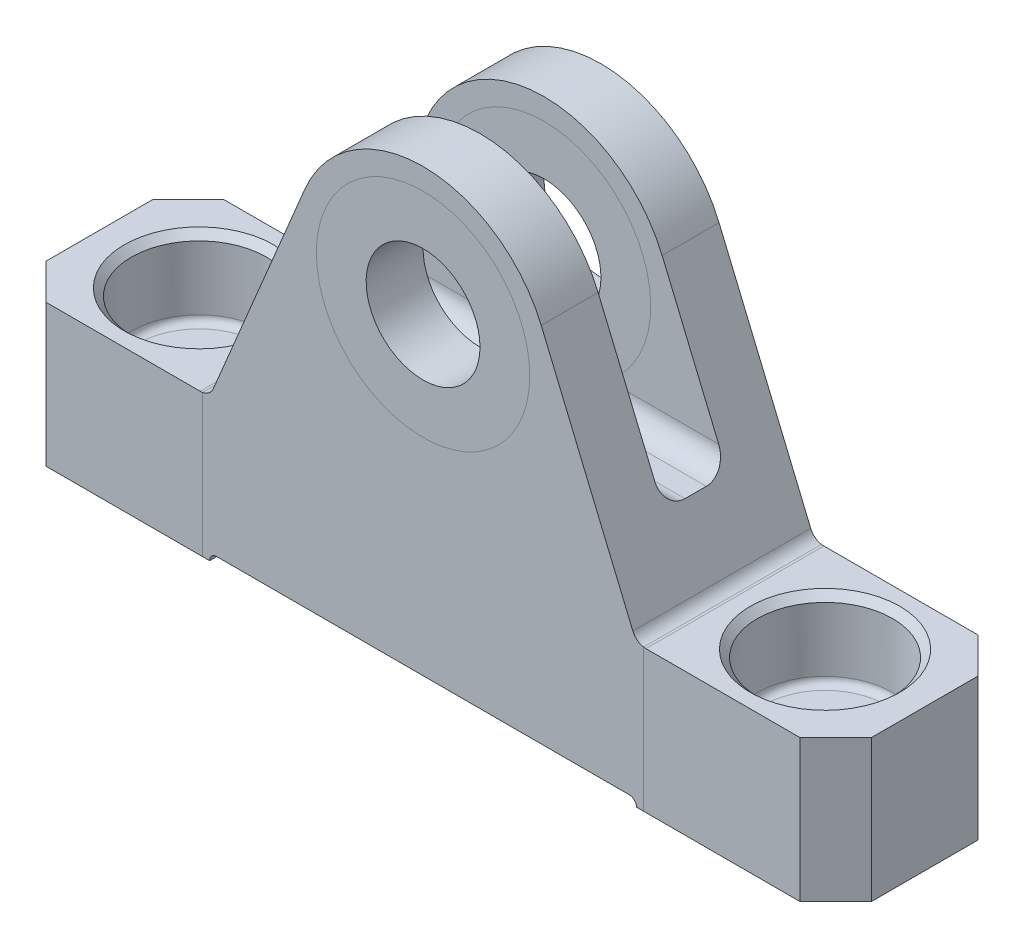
ISO-10303-21;
HEADER;
FILE_DESCRIPTION(('STEP AP214'),'2;1');
FILE_NAME('part.step','',(''),(''),'','','');
FILE_SCHEMA(('AUTOMOTIVE_DESIGN { 1 0 10303 214 1 1 1 1 }'));
ENDSEC;
DATA;
#1=APPLICATION_CONTEXT('core data for automotive mechanical design processes');
#2=APPLICATION_PROTOCOL_DEFINITION('international standard','automotive_design',2000,#1);
#3=PRODUCT_CONTEXT('',#1,'mechanical');
#4=PRODUCT('Part','Part','',(#3));
#5=PRODUCT_RELATED_PRODUCT_CATEGORY('part','',(#4));
#6=PRODUCT_DEFINITION_FORMATION('','',#4);
#7=PRODUCT_DEFINITION_CONTEXT('part definition',#1,'design');
#8=PRODUCT_DEFINITION('design','',#6,#7);
#9=PRODUCT_DEFINITION_SHAPE('','',#8);
#10=(LENGTH_UNIT() NAMED_UNIT(*) SI_UNIT(.MILLI.,.METRE.));
#11=(NAMED_UNIT(*) PLANE_ANGLE_UNIT() SI_UNIT($,.RADIAN.));
#12=(NAMED_UNIT(*) SI_UNIT($,.STERADIAN.) SOLID_ANGLE_UNIT());
#13=UNCERTAINTY_MEASURE_WITH_UNIT(LENGTH_MEASURE(1.E-05),#10,'distance_accuracy_value','');
#14=(GEOMETRIC_REPRESENTATION_CONTEXT(3) GLOBAL_UNCERTAINTY_ASSIGNED_CONTEXT((#13)) GLOBAL_UNIT_ASSIGNED_CONTEXT((#10,
#11,#12)) REPRESENTATION_CONTEXT('',''));
#15=CARTESIAN_POINT('',(0.,0.,0.));
#16=DIRECTION('',(0.,0.,1.));
#17=DIRECTION('',(1.,0.,0.));
#18=AXIS2_PLACEMENT_3D('',#15,#16,#17);
#19=CARTESIAN_POINT('',(0.,45.,12.51));
#20=DIRECTION('',(0.,0.,-1.));
#21=DIRECTION('',(-1.,0.,0.));
#22=AXIS2_PLACEMENT_3D('',#19,#20,#21);
#23=CYLINDRICAL_SURFACE('',#22,15.);
#24=CARTESIAN_POINT('',(-8.94942491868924,32.9622346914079,4.5));
#25=CARTESIAN_POINT('',(-8.85354834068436,32.8909533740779,4.49999300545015));
#26=CARTESIAN_POINT('',(-8.75684192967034,32.8208385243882,4.49746043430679));
#27=CARTESIAN_POINT('',(-8.56196689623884,32.683062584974,4.48778160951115));
#28=CARTESIAN_POINT('',(-8.46379875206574,32.61540071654,4.48063683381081));
#29=CARTESIAN_POINT('',(-8.16770513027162,32.4164772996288,4.45297474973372));
#30=CARTESIAN_POINT('',(-7.9678008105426,32.2889884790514,4.42622608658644));
#31=CARTESIAN_POINT('',(-7.56589466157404,32.0457760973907,4.35934563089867));
#32=CARTESIAN_POINT('',(-7.36393123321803,31.9299515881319,4.31934441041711));
#33=CARTESIAN_POINT('',(-6.95670761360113,31.7087263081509,4.22819173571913));
#34=CARTESIAN_POINT('',(-6.7514453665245,31.6033323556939,4.17703305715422));
#35=CARTESIAN_POINT('',(-6.20226069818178,31.3370234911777,4.02880923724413));
#36=CARTESIAN_POINT('',(-5.85604560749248,31.185254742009,3.92369966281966));
#37=CARTESIAN_POINT('',(-5.1584160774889,30.9098776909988,3.69541048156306));
#38=CARTESIAN_POINT('',(-4.80699904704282,30.7862839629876,3.57222157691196));
#39=CARTESIAN_POINT('',(-4.09644074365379,30.5653517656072,3.31225961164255));
#40=CARTESIAN_POINT('',(-3.73725712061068,30.4683017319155,3.17535783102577));
#41=CARTESIAN_POINT('',(-3.19580824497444,30.3432242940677,2.96541091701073));
#42=CARTESIAN_POINT('',(-3.01492924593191,30.3049557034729,2.89468275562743));
#43=CARTESIAN_POINT('',(-2.65208013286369,30.2351562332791,2.75271122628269));
#44=CARTESIAN_POINT('',(-2.47011011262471,30.2036247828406,2.68146790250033));
#45=CARTESIAN_POINT('',(-2.13763209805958,30.152323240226,2.55275619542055));
#46=CARTESIAN_POINT('',(-1.98735741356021,30.1314577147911,2.49511683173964));
#47=CARTESIAN_POINT('',(-1.68526629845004,30.0941936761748,2.38197492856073));
#48=CARTESIAN_POINT('',(-1.53344853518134,30.0777994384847,2.32647447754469));
#49=CARTESIAN_POINT('',(-1.23016872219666,30.0497646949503,2.22139212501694));
#50=CARTESIAN_POINT('',(-1.07874217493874,30.0380501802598,2.17172764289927));
#51=CARTESIAN_POINT('',(-0.772451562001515,30.0191195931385,2.08318086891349));
#52=CARTESIAN_POINT('',(-0.61759440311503,30.0118952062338,2.04427872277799));
#53=CARTESIAN_POINT('',(-0.379976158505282,30.0045972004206,2.00259991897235));
#54=CARTESIAN_POINT('',(-0.298810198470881,30.0027545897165,1.99145605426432));
#55=CARTESIAN_POINT('',(-0.135814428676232,30.0003938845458,1.97702662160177));
#56=CARTESIAN_POINT('',(-0.0539854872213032,29.9998742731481,1.97373205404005));
#57=CARTESIAN_POINT('',(0.109785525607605,30.0001776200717,1.97562425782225));
#58=CARTESIAN_POINT('',(0.191727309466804,30.00100419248,1.98083386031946));
#59=CARTESIAN_POINT('',(0.354806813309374,30.0039745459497,1.99877345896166));
#60=CARTESIAN_POINT('',(0.435943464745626,30.006119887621,2.0115123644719));
#61=CARTESIAN_POINT('',(0.638380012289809,30.013093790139,2.05056576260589));
#62=CARTESIAN_POINT('',(0.758928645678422,30.018734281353,2.08049207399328));
#63=CARTESIAN_POINT('',(0.997891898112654,30.0327502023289,2.14753414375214));
#64=CARTESIAN_POINT('',(1.11630341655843,30.0411293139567,2.18465955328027));
#65=CARTESIAN_POINT('',(1.35192863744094,30.060579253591,2.26290962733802));
#66=CARTESIAN_POINT('',(1.4691380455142,30.0716575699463,2.30404522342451));
#67=CARTESIAN_POINT('',(1.70251073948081,30.0964694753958,2.38844492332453));
#68=CARTESIAN_POINT('',(1.81867386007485,30.1102034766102,2.43170935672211));
#69=CARTESIAN_POINT('',(2.17038539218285,30.1559417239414,2.56469530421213));
#70=CARTESIAN_POINT('',(2.40478355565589,30.1921201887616,2.6560552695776));
#71=CARTESIAN_POINT('',(2.87123322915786,30.2754629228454,2.83841702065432));
#72=CARTESIAN_POINT('',(3.10328815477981,30.3226076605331,2.92941915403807));
#73=CARTESIAN_POINT('',(3.71632379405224,30.4623833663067,3.16740429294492));
#74=CARTESIAN_POINT('',(4.09598903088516,30.5646540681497,3.31229625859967));
#75=CARTESIAN_POINT('',(4.85118365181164,30.800610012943,3.58817131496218));
#76=CARTESIAN_POINT('',(5.22670754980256,30.9343326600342,3.71913757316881));
#77=CARTESIAN_POINT('',(5.96818184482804,31.2326928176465,3.95864169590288));
#78=CARTESIAN_POINT('',(6.33419035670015,31.3970089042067,4.06739010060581));
#79=CARTESIAN_POINT('',(6.8765759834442,31.6675771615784,4.20816512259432));
#80=CARTESIAN_POINT('',(7.05617176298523,31.7617251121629,4.25134828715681));
#81=CARTESIAN_POINT('',(7.41281126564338,31.9580821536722,4.32892634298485));
#82=CARTESIAN_POINT('',(7.58985590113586,32.0602882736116,4.36332445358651));
#83=CARTESIAN_POINT('',(7.8663203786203,32.227570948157,4.40934379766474));
#84=CARTESIAN_POINT('',(7.96678545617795,32.289989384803,4.42443500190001));
#85=CARTESIAN_POINT('',(8.16654328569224,32.4174088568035,4.45082991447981));
#86=CARTESIAN_POINT('',(8.26583631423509,32.4824092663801,4.46213453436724));
#87=CARTESIAN_POINT('',(8.46338417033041,32.6151173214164,4.48060605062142));
#88=CARTESIAN_POINT('',(8.56163549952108,32.6828317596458,4.48776176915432));
#89=CARTESIAN_POINT('',(8.75668005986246,32.8207206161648,4.49745575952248));
#90=CARTESIAN_POINT('',(8.85347273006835,32.8908959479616,4.49999229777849));
#91=CARTESIAN_POINT('',(8.94942491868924,32.9622346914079,4.5));
#92=B_SPLINE_CURVE_WITH_KNOTS('',3,(#24,#25,#26,#27,#28,#29,#30,#31,#32,#33,#34,#35,#36,#37,#38,
#39,#40,#41,#42,#43,#44,#45,#46,#47,#48,#49,#50,#51,#52,#53,#54,#55,#56,#57,#58,#59,#60,#61,#62,
#63,#64,#65,#66,#67,#68,#69,#70,#71,#72,#73,#74,#75,#76,#77,#78,#79,#80,#81,#82,#83,#84,#85,#86,
#87,#88,#89,#90,#91),.UNSPECIFIED.,.F.,.F.,(4,2,2,2,2,2,2,2,2,2,2,2,2,2,2,2,2,2,2,2,2,2,2,2,2,2,
2,2,2,2,2,2,2,4),(0.,0.358328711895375,0.716542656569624,1.43151933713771,2.13965133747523,
2.84824321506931,4.0234900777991,5.19934347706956,6.38750784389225,6.9812673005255,
7.57497642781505,8.06180665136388,8.54910076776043,9.02835041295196,9.50670995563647,
9.7522385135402,9.99748542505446,10.2433918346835,10.4895898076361,10.8621008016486,
11.2351146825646,11.6091754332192,11.9832942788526,12.7454807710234,13.5063200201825,
14.7620732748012,16.0193275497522,17.2640503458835,17.885742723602,18.5072069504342,
18.8648339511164,19.2223747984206,19.5808744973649,19.9395087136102),.UNSPECIFIED.);
#93=CARTESIAN_POINT('',(-8.94942491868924,32.9622346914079,4.5));
#94=VERTEX_POINT('',#93);
#95=CARTESIAN_POINT('',(8.94942491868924,32.9622346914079,4.5));
#96=VERTEX_POINT('',#95);
#97=EDGE_CURVE('E12',#94,#96,#92,.T.);
#98=ORIENTED_EDGE('',*,*,#97,.T.);
#99=CARTESIAN_POINT('',(0.,45.,4.5));
#100=DIRECTION('',(0.,0.,1.));
#101=DIRECTION('',(0.,-1.,0.));
#102=AXIS2_PLACEMENT_3D('',#99,#100,#101);
#103=CIRCLE('',#102,15.);
#104=EDGE_CURVE('E66',#96,#94,#103,.T.);
#105=ORIENTED_EDGE('',*,*,#104,.T.);
#106=EDGE_LOOP('',(#98,#105));
#107=FACE_BOUND('',#106,.T.);
#108=CARTESIAN_POINT('',(0.,45.,12.5));
#109=DIRECTION('',(0.,0.,1.));
#110=DIRECTION('',(1.,0.,0.));
#111=AXIS2_PLACEMENT_3D('',#108,#109,#110);
#112=CIRCLE('',#111,15.);
#113=CARTESIAN_POINT('',(15.,45.,12.5));
#114=VERTEX_POINT('',#113);
#115=EDGE_CURVE('E61',#114,#114,#112,.T.);
#116=ORIENTED_EDGE('',*,*,#115,.F.);
#117=EDGE_LOOP('',(#116));
#118=FACE_BOUND('',#117,.T.);
#119=ADVANCED_FACE('F57',(#107,#118),#23,.T.);
#120=CARTESIAN_POINT('',(0.,45.,12.5));
#121=DIRECTION('',(0.,0.,-1.));
#122=DIRECTION('',(-1.,0.,0.));
#123=AXIS2_PLACEMENT_3D('',#120,#121,#122);
#124=CYLINDRICAL_SURFACE('',#123,8.);
#125=CARTESIAN_POINT('',(0.,45.,4.5));
#126=DIRECTION('',(0.,0.,1.));
#127=DIRECTION('',(0.,-1.,0.));
#128=AXIS2_PLACEMENT_3D('',#125,#126,#127);
#129=CIRCLE('',#128,8.);
#130=CARTESIAN_POINT('',(0.,37.,4.5));
#131=VERTEX_POINT('',#130);
#132=EDGE_CURVE('E106',#131,#131,#129,.T.);
#133=ORIENTED_EDGE('',*,*,#132,.F.);
#134=EDGE_LOOP('',(#133));
#135=FACE_BOUND('',#134,.T.);
#136=CARTESIAN_POINT('',(0.,45.,12.5));
#137=DIRECTION('',(0.,0.,1.));
#138=DIRECTION('',(1.,0.,0.));
#139=AXIS2_PLACEMENT_3D('',#136,#137,#138);
#140=CIRCLE('',#139,8.);
#141=CARTESIAN_POINT('',(8.,45.,12.5));
#142=VERTEX_POINT('',#141);
#143=EDGE_CURVE('E78',#142,#142,#140,.T.);
#144=ORIENTED_EDGE('',*,*,#143,.T.);
#145=EDGE_LOOP('',(#144));
#146=FACE_BOUND('',#145,.T.);
#147=ADVANCED_FACE('F91',(#135,#146),#124,.F.);
#148=CARTESIAN_POINT('',(-58.,63.,4.5));
#149=DIRECTION('',(0.,0.,1.));
#150=DIRECTION('',(0.,-1.,0.));
#151=AXIS2_PLACEMENT_3D('',#148,#149,#150);
#152=PLANE('',#151);
#153=ORIENTED_EDGE('',*,*,#132,.T.);
#154=EDGE_LOOP('',(#153));
#155=FACE_BOUND('',#154,.T.);
#156=ORIENTED_EDGE('',*,*,#104,.F.);
#157=DIRECTION('',(1.,0.,0.));
#158=VECTOR('',#157,1.);
#159=CARTESIAN_POINT('',(-25.8121930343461,32.9622346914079,4.5));
#160=LINE('',#159,#158);
#161=EDGE_CURVE('E73',#96,#94,#160,.F.);
#162=ORIENTED_EDGE('',*,*,#161,.T.);
#163=EDGE_LOOP('',(#156,#162));
#164=FACE_BOUND('',#163,.T.);
#165=ADVANCED_FACE('F77',(#155,#164),#152,.F.);
#166=CARTESIAN_POINT('',(-58.,32.9622346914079,1.5));
#167=DIRECTION('',(-1.,0.,0.));
#168=DIRECTION('',(0.,0.,1.));
#169=AXIS2_PLACEMENT_3D('',#166,#167,#168);
#170=CYLINDRICAL_SURFACE('',#169,3.);
#171=ORIENTED_EDGE('',*,*,#97,.F.);
#172=ORIENTED_EDGE('',*,*,#161,.F.);
#173=EDGE_LOOP('',(#171,#172));
#174=FACE_BOUND('',#173,.T.);
#175=ADVANCED_FACE('F82',(#174),#170,.F.);
#176=CARTESIAN_POINT('',(0.,45.,12.5));
#177=DIRECTION('',(0.,0.,1.));
#178=DIRECTION('',(1.,0.,0.));
#179=AXIS2_PLACEMENT_3D('',#176,#177,#178);
#180=PLANE('',#179);
#181=ORIENTED_EDGE('',*,*,#143,.F.);
#182=EDGE_LOOP('',(#181));
#183=FACE_BOUND('',#182,.T.);
#184=ORIENTED_EDGE('',*,*,#115,.T.);
#185=EDGE_LOOP('',(#184));
#186=FACE_BOUND('',#185,.T.);
#187=ADVANCED_FACE('F84',(#183,#186),#180,.T.);
#188=CLOSED_SHELL('',(#119,#147,#165,#175,#187));
#189=MANIFOLD_SOLID_BREP('B2',#188);
#190=CARTESIAN_POINT('',(31.,36.9945833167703,12.51));
#191=DIRECTION('',(-1.,0.,0.));
#192=DIRECTION('',(0.,-1.,0.));
#193=AXIS2_PLACEMENT_3D('',#190,#191,#192);
#194=PLANE('',#193);
#195=DIRECTION('',(0.,-1.,0.));
#196=VECTOR('',#195,1.);
#197=CARTESIAN_POINT('',(31.,45.,12.5));
#198=LINE('',#197,#196);
#199=CARTESIAN_POINT('',(31.,19.9897706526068,12.5));
#200=VERTEX_POINT('',#199);
#201=CARTESIAN_POINT('',(31.,0.,12.5));
#202=VERTEX_POINT('',#201);
#203=EDGE_CURVE('E162',#200,#202,#198,.T.);
#204=ORIENTED_EDGE('',*,*,#203,.F.);
#205=DIRECTION('',(0.,0.,1.));
#206=VECTOR('',#205,1.);
#207=CARTESIAN_POINT('',(31.,19.9897706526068,12.5));
#208=LINE('',#207,#206);
#209=CARTESIAN_POINT('',(31.,19.9897706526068,-12.5));
#210=VERTEX_POINT('',#209);
#211=EDGE_CURVE('E239',#200,#210,#208,.F.);
#212=ORIENTED_EDGE('',*,*,#211,.T.);
#213=DIRECTION('',(0.,-1.,0.));
#214=VECTOR('',#213,1.);
#215=CARTESIAN_POINT('',(31.,45.,-12.5));
#216=LINE('',#215,#214);
#217=CARTESIAN_POINT('',(31.,0.,-12.5));
#218=VERTEX_POINT('',#217);
#219=EDGE_CURVE('E224',#210,#218,#216,.T.);
#220=ORIENTED_EDGE('',*,*,#219,.T.);
#221=DIRECTION('',(0.,0.,1.));
#222=VECTOR('',#221,1.);
#223=CARTESIAN_POINT('',(31.,0.,12.5));
#224=LINE('',#223,#222);
#225=EDGE_CURVE('E234',#218,#202,#224,.T.);
#226=ORIENTED_EDGE('',*,*,#225,.T.);
#227=EDGE_LOOP('',(#204,#212,#220,#226));
#228=FACE_BOUND('',#227,.T.);
#229=ADVANCED_FACE('F158',(#228),#194,.T.);
#230=CARTESIAN_POINT('',(31.3307349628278,21.9622346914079,12.5));
#231=DIRECTION('',(0.,0.,1.));
#232=DIRECTION('',(1.,0.,0.));
#233=AXIS2_PLACEMENT_3D('',#230,#231,#232);
#234=CYLINDRICAL_SURFACE('',#233,2.);
#235=ORIENTED_EDGE('',*,*,#211,.F.);
#236=CARTESIAN_POINT('',(31.3307349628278,21.9622346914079,12.5));
#237=DIRECTION('',(0.,0.,1.));
#238=DIRECTION('',(1.,0.,0.));
#239=AXIS2_PLACEMENT_3D('',#236,#237,#238);
#240=CIRCLE('',#239,2.);
#241=CARTESIAN_POINT('',(31.3307349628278,19.9622346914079,12.5));
#242=VERTEX_POINT('',#241);
#243=EDGE_CURVE('E55',#242,#200,#240,.F.);
#244=ORIENTED_EDGE('',*,*,#243,.F.);
#245=DIRECTION('',(0.,0.,-1.));
#246=VECTOR('',#245,1.);
#247=CARTESIAN_POINT('',(31.3307349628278,19.9622346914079,12.5));
#248=LINE('',#247,#246);
#249=CARTESIAN_POINT('',(31.3307349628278,19.9622346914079,-12.5));
#250=VERTEX_POINT('',#249);
#251=EDGE_CURVE('E184',#250,#242,#248,.F.);
#252=ORIENTED_EDGE('',*,*,#251,.F.);
#253=CARTESIAN_POINT('',(31.3307349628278,21.9622346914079,-12.5));
#254=DIRECTION('',(0.,0.,1.));
#255=DIRECTION('',(1.,0.,0.));
#256=AXIS2_PLACEMENT_3D('',#253,#254,#255);
#257=CIRCLE('',#256,2.);
#258=EDGE_CURVE('E168',#210,#250,#257,.T.);
#259=ORIENTED_EDGE('',*,*,#258,.F.);
#260=EDGE_LOOP('',(#235,#244,#252,#259));
#261=FACE_BOUND('',#260,.T.);
#262=ADVANCED_FACE('F328',(#261),#234,.F.);
#263=CARTESIAN_POINT('',(0.,0.,12.5));
#264=DIRECTION('',(0.,1.,0.));
#265=DIRECTION('',(0.,0.,1.));
#266=AXIS2_PLACEMENT_3D('',#263,#264,#265);
#267=PLANE('',#266);
#268=CARTESIAN_POINT('',(44.,0.,0.));
#269=DIRECTION('',(0.,-1.,0.));
#270=DIRECTION('',(0.,0.,1.));
#271=AXIS2_PLACEMENT_3D('',#268,#269,#270);
#272=CIRCLE('',#271,4.5);
#273=CARTESIAN_POINT('',(44.,0.,4.49999999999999));
#274=VERTEX_POINT('',#273);
#275=EDGE_CURVE('E230',#274,#274,#272,.T.);
#276=ORIENTED_EDGE('',*,*,#275,.F.);
#277=EDGE_LOOP('',(#276));
#278=FACE_BOUND('',#277,.T.);
#279=ORIENTED_EDGE('',*,*,#225,.F.);
#280=DIRECTION('',(1.,0.,0.));
#281=VECTOR('',#280,1.);
#282=CARTESIAN_POINT('',(0.,0.,-12.5));
#283=LINE('',#282,#281);
#284=CARTESIAN_POINT('',(53.,0.,-12.5));
#285=VERTEX_POINT('',#284);
#286=EDGE_CURVE('E221',#218,#285,#283,.T.);
#287=ORIENTED_EDGE('',*,*,#286,.T.);
#288=DIRECTION('',(-0.707106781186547,0.,-0.707106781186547));
#289=VECTOR('',#288,1.);
#290=CARTESIAN_POINT('',(58.,0.,-7.5));
#291=LINE('',#290,#289);
#292=CARTESIAN_POINT('',(58.,0.,-7.5));
#293=VERTEX_POINT('',#292);
#294=EDGE_CURVE('E300',#285,#293,#291,.F.);
#295=ORIENTED_EDGE('',*,*,#294,.T.);
#296=DIRECTION('',(0.,0.,-1.));
#297=VECTOR('',#296,1.);
#298=CARTESIAN_POINT('',(58.,0.,12.5));
#299=LINE('',#298,#297);
#300=CARTESIAN_POINT('',(58.,0.,7.49999999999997));
#301=VERTEX_POINT('',#300);
#302=EDGE_CURVE('E260',#301,#293,#299,.T.);
#303=ORIENTED_EDGE('',*,*,#302,.F.);
#304=DIRECTION('',(-0.707106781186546,0.,0.70710678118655));
#305=VECTOR('',#304,1.);
#306=CARTESIAN_POINT('',(53.,0.,12.5));
#307=LINE('',#306,#305);
#308=CARTESIAN_POINT('',(53.,0.,12.5));
#309=VERTEX_POINT('',#308);
#310=EDGE_CURVE('E302',#301,#309,#307,.T.);
#311=ORIENTED_EDGE('',*,*,#310,.T.);
#312=DIRECTION('',(1.,0.,0.));
#313=VECTOR('',#312,1.);
#314=CARTESIAN_POINT('',(0.,0.,12.5));
#315=LINE('',#314,#313);
#316=EDGE_CURVE('E237',#202,#309,#315,.T.);
#317=ORIENTED_EDGE('',*,*,#316,.F.);
#318=EDGE_LOOP('',(#279,#287,#295,#303,#311,#317));
#319=FACE_BOUND('',#318,.T.);
#320=ADVANCED_FACE('F235',(#278,#319),#267,.F.);
#321=CARTESIAN_POINT('',(0.,45.,-12.5));
#322=DIRECTION('',(0.,0.,1.));
#323=DIRECTION('',(1.,0.,0.));
#324=AXIS2_PLACEMENT_3D('',#321,#322,#323);
#325=PLANE('',#324);
#326=ORIENTED_EDGE('',*,*,#219,.F.);
#327=ORIENTED_EDGE('',*,*,#258,.T.);
#328=DIRECTION('',(-1.,0.,0.));
#329=VECTOR('',#328,1.);
#330=CARTESIAN_POINT('',(58.,19.9622346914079,-12.5));
#331=LINE('',#330,#329);
#332=CARTESIAN_POINT('',(53.,19.9622346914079,-12.5));
#333=VERTEX_POINT('',#332);
#334=EDGE_CURVE('E229',#333,#250,#331,.T.);
#335=ORIENTED_EDGE('',*,*,#334,.F.);
#336=DIRECTION('',(0.,-1.,0.));
#337=VECTOR('',#336,1.);
#338=CARTESIAN_POINT('',(53.,45.,-12.5));
#339=LINE('',#338,#337);
#340=EDGE_CURVE('E226',#333,#285,#339,.T.);
#341=ORIENTED_EDGE('',*,*,#340,.T.);
#342=ORIENTED_EDGE('',*,*,#286,.F.);
#343=EDGE_LOOP('',(#326,#327,#335,#341,#342));
#344=FACE_BOUND('',#343,.T.);
#345=ADVANCED_FACE('F160',(#344),#325,.F.);
#346=CARTESIAN_POINT('',(0.,45.,12.5));
#347=DIRECTION('',(0.,0.,1.));
#348=DIRECTION('',(1.,0.,0.));
#349=AXIS2_PLACEMENT_3D('',#346,#347,#348);
#350=PLANE('',#349);
#351=ORIENTED_EDGE('',*,*,#243,.T.);
#352=ORIENTED_EDGE('',*,*,#203,.T.);
#353=ORIENTED_EDGE('',*,*,#316,.T.);
#354=DIRECTION('',(0.,1.,0.));
#355=VECTOR('',#354,1.);
#356=CARTESIAN_POINT('',(53.,19.9622346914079,12.5));
#357=LINE('',#356,#355);
#358=CARTESIAN_POINT('',(53.,19.9622346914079,12.5));
#359=VERTEX_POINT('',#358);
#360=EDGE_CURVE('E297',#309,#359,#357,.T.);
#361=ORIENTED_EDGE('',*,*,#360,.T.);
#362=DIRECTION('',(-1.,0.,0.));
#363=VECTOR('',#362,1.);
#364=CARTESIAN_POINT('',(58.,19.9622346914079,12.5));
#365=LINE('',#364,#363);
#366=EDGE_CURVE('E270',#359,#242,#365,.T.);
#367=ORIENTED_EDGE('',*,*,#366,.T.);
#368=EDGE_LOOP('',(#351,#352,#353,#361,#367));
#369=FACE_BOUND('',#368,.T.);
#370=ADVANCED_FACE('F316',(#369),#350,.T.);
#371=CARTESIAN_POINT('',(44.,9.96223469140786,0.));
#372=DIRECTION('',(0.,1.,0.));
#373=DIRECTION('',(0.,0.,1.));
#374=AXIS2_PLACEMENT_3D('',#371,#372,#373);
#375=TOROIDAL_SURFACE('',#374,8.5,1.);
#376=CARTESIAN_POINT('',(44.,8.96223469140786,0.));
#377=DIRECTION('',(0.,1.,0.));
#378=DIRECTION('',(0.,0.,1.));
#379=AXIS2_PLACEMENT_3D('',#376,#377,#378);
#380=CIRCLE('',#379,8.5);
#381=CARTESIAN_POINT('',(44.,8.96223469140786,8.5));
#382=VERTEX_POINT('',#381);
#383=EDGE_CURVE('E284',#382,#382,#380,.T.);
#384=ORIENTED_EDGE('',*,*,#383,.F.);
#385=EDGE_LOOP('',(#384));
#386=FACE_BOUND('',#385,.T.);
#387=CARTESIAN_POINT('',(44.,9.96223469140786,0.));
#388=DIRECTION('',(0.,1.,0.));
#389=DIRECTION('',(0.,0.,1.));
#390=AXIS2_PLACEMENT_3D('',#387,#388,#389);
#391=CIRCLE('',#390,9.5);
#392=CARTESIAN_POINT('',(44.,9.96223469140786,9.5));
#393=VERTEX_POINT('',#392);
#394=EDGE_CURVE('E262',#393,#393,#391,.F.);
#395=ORIENTED_EDGE('',*,*,#394,.F.);
#396=EDGE_LOOP('',(#395));
#397=FACE_BOUND('',#396,.T.);
#398=ADVANCED_FACE('F338',(#386,#397),#375,.F.);
#399=CARTESIAN_POINT('',(44.,8.96223469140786,0.));
#400=DIRECTION('',(0.,1.,0.));
#401=DIRECTION('',(0.,0.,1.));
#402=AXIS2_PLACEMENT_3D('',#399,#400,#401);
#403=CYLINDRICAL_SURFACE('',#402,9.5);
#404=CARTESIAN_POINT('',(44.,18.9622346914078,0.));
#405=DIRECTION('',(0.,-1.,0.));
#406=DIRECTION('',(0.,0.,-1.));
#407=AXIS2_PLACEMENT_3D('',#404,#405,#406);
#408=CIRCLE('',#407,9.5);
#409=CARTESIAN_POINT('',(44.,18.9622346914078,-9.50000000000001));
#410=VERTEX_POINT('',#409);
#411=EDGE_CURVE('E292',#410,#410,#408,.F.);
#412=ORIENTED_EDGE('',*,*,#411,.T.);
#413=EDGE_LOOP('',(#412));
#414=FACE_BOUND('',#413,.T.);
#415=ORIENTED_EDGE('',*,*,#394,.T.);
#416=EDGE_LOOP('',(#415));
#417=FACE_BOUND('',#416,.T.);
#418=ADVANCED_FACE('F344',(#414,#417),#403,.F.);
#419=CARTESIAN_POINT('',(44.,8.96223469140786,0.));
#420=DIRECTION('',(0.,1.,0.));
#421=DIRECTION('',(0.,0.,1.));
#422=AXIS2_PLACEMENT_3D('',#419,#420,#421);
#423=PLANE('',#422);
#424=ORIENTED_EDGE('',*,*,#383,.T.);
#425=EDGE_LOOP('',(#424));
#426=FACE_BOUND('',#425,.T.);
#427=CARTESIAN_POINT('',(44.,8.96223469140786,0.));
#428=DIRECTION('',(0.,1.,0.));
#429=DIRECTION('',(0.,0.,1.));
#430=AXIS2_PLACEMENT_3D('',#427,#428,#429);
#431=CIRCLE('',#430,4.5);
#432=CARTESIAN_POINT('',(44.,8.96223469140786,4.49999999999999));
#433=VERTEX_POINT('',#432);
#434=EDGE_CURVE('E248',#433,#433,#431,.T.);
#435=ORIENTED_EDGE('',*,*,#434,.F.);
#436=EDGE_LOOP('',(#435));
#437=FACE_BOUND('',#436,.T.);
#438=ADVANCED_FACE('F363',(#426,#437),#423,.T.);
#439=CARTESIAN_POINT('',(44.,19.9622346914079,0.));
#440=DIRECTION('',(0.,1.,0.));
#441=DIRECTION('',(0.,0.,1.));
#442=AXIS2_PLACEMENT_3D('',#439,#440,#441);
#443=CONICAL_SURFACE('',#442,10.5,0.785398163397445);
#444=ORIENTED_EDGE('',*,*,#411,.F.);
#445=EDGE_LOOP('',(#444));
#446=FACE_BOUND('',#445,.T.);
#447=CARTESIAN_POINT('',(44.,19.9622346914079,0.));
#448=DIRECTION('',(0.,-1.,0.));
#449=DIRECTION('',(0.,0.,-1.));
#450=AXIS2_PLACEMENT_3D('',#447,#448,#449);
#451=CIRCLE('',#450,10.5);
#452=CARTESIAN_POINT('',(44.,19.9622346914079,-10.5));
#453=VERTEX_POINT('',#452);
#454=EDGE_CURVE('E288',#453,#453,#451,.T.);
#455=ORIENTED_EDGE('',*,*,#454,.F.);
#456=EDGE_LOOP('',(#455));
#457=FACE_BOUND('',#456,.T.);
#458=ADVANCED_FACE('F359',(#446,#457),#443,.F.);
#459=CARTESIAN_POINT('',(58.,0.,12.5));
#460=DIRECTION('',(-1.,0.,0.));
#461=DIRECTION('',(0.,0.,1.));
#462=AXIS2_PLACEMENT_3D('',#459,#460,#461);
#463=PLANE('',#462);
#464=DIRECTION('',(0.,0.,-1.));
#465=VECTOR('',#464,1.);
#466=CARTESIAN_POINT('',(58.,19.9622346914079,12.5));
#467=LINE('',#466,#465);
#468=CARTESIAN_POINT('',(58.,19.9622346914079,7.49999999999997));
#469=VERTEX_POINT('',#468);
#470=CARTESIAN_POINT('',(58.,19.9622346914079,-7.5));
#471=VERTEX_POINT('',#470);
#472=EDGE_CURVE('E273',#469,#471,#467,.T.);
#473=ORIENTED_EDGE('',*,*,#472,.F.);
#474=DIRECTION('',(0.,-1.,0.));
#475=VECTOR('',#474,1.);
#476=CARTESIAN_POINT('',(58.,0.,7.49999999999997));
#477=LINE('',#476,#475);
#478=EDGE_CURVE('E312',#469,#301,#477,.T.);
#479=ORIENTED_EDGE('',*,*,#478,.T.);
#480=ORIENTED_EDGE('',*,*,#302,.T.);
#481=DIRECTION('',(0.,1.,0.));
#482=VECTOR('',#481,1.);
#483=CARTESIAN_POINT('',(58.,0.,-7.5));
#484=LINE('',#483,#482);
#485=EDGE_CURVE('E310',#293,#471,#484,.T.);
#486=ORIENTED_EDGE('',*,*,#485,.T.);
#487=EDGE_LOOP('',(#473,#479,#480,#486));
#488=FACE_BOUND('',#487,.T.);
#489=ADVANCED_FACE('F323',(#488),#463,.F.);
#490=CARTESIAN_POINT('',(44.,0.,0.));
#491=DIRECTION('',(0.,1.,0.));
#492=DIRECTION('',(0.,0.,1.));
#493=AXIS2_PLACEMENT_3D('',#490,#491,#492);
#494=CYLINDRICAL_SURFACE('',#493,4.5);
#495=ORIENTED_EDGE('',*,*,#275,.T.);
#496=EDGE_LOOP('',(#495));
#497=FACE_BOUND('',#496,.T.);
#498=ORIENTED_EDGE('',*,*,#434,.T.);
#499=EDGE_LOOP('',(#498));
#500=FACE_BOUND('',#499,.T.);
#501=ADVANCED_FACE('F356',(#497,#500),#494,.F.);
#502=CARTESIAN_POINT('',(53.,45.,12.5));
#503=DIRECTION('',(0.707106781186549,0.,0.707106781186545));
#504=DIRECTION('',(0.,-1.,0.));
#505=AXIS2_PLACEMENT_3D('',#502,#503,#504);
#506=PLANE('',#505);
#507=ORIENTED_EDGE('',*,*,#310,.F.);
#508=ORIENTED_EDGE('',*,*,#478,.F.);
#509=DIRECTION('',(0.707106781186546,0.,-0.70710678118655));
#510=VECTOR('',#509,1.);
#511=CARTESIAN_POINT('',(53.,19.9622346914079,12.5));
#512=LINE('',#511,#510);
#513=EDGE_CURVE('E308',#359,#469,#512,.T.);
#514=ORIENTED_EDGE('',*,*,#513,.F.);
#515=ORIENTED_EDGE('',*,*,#360,.F.);
#516=EDGE_LOOP('',(#507,#508,#514,#515));
#517=FACE_BOUND('',#516,.T.);
#518=ADVANCED_FACE('F321',(#517),#506,.T.);
#519=CARTESIAN_POINT('',(58.,0.,-7.5));
#520=DIRECTION('',(-0.707106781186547,0.,0.707106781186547));
#521=DIRECTION('',(0.,1.,0.));
#522=AXIS2_PLACEMENT_3D('',#519,#520,#521);
#523=PLANE('',#522);
#524=ORIENTED_EDGE('',*,*,#294,.F.);
#525=ORIENTED_EDGE('',*,*,#340,.F.);
#526=DIRECTION('',(0.707106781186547,0.,0.707106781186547));
#527=VECTOR('',#526,1.);
#528=CARTESIAN_POINT('',(58.,19.9622346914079,-7.5));
#529=LINE('',#528,#527);
#530=EDGE_CURVE('E306',#471,#333,#529,.F.);
#531=ORIENTED_EDGE('',*,*,#530,.F.);
#532=ORIENTED_EDGE('',*,*,#485,.F.);
#533=EDGE_LOOP('',(#524,#525,#531,#532));
#534=FACE_BOUND('',#533,.T.);
#535=ADVANCED_FACE('F325',(#534),#523,.F.);
#536=CARTESIAN_POINT('',(58.,19.9622346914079,12.5));
#537=DIRECTION('',(0.,-1.,0.));
#538=DIRECTION('',(0.,0.,-1.));
#539=AXIS2_PLACEMENT_3D('',#536,#537,#538);
#540=PLANE('',#539);
#541=ORIENTED_EDGE('',*,*,#454,.T.);
#542=EDGE_LOOP('',(#541));
#543=FACE_BOUND('',#542,.T.);
#544=ORIENTED_EDGE('',*,*,#334,.T.);
#545=ORIENTED_EDGE('',*,*,#251,.T.);
#546=ORIENTED_EDGE('',*,*,#366,.F.);
#547=ORIENTED_EDGE('',*,*,#513,.T.);
#548=ORIENTED_EDGE('',*,*,#472,.T.);
#549=ORIENTED_EDGE('',*,*,#530,.T.);
#550=EDGE_LOOP('',(#544,#545,#546,#547,#548,#549));
#551=FACE_BOUND('',#550,.T.);
#552=ADVANCED_FACE('F322',(#543,#551),#540,.F.);
#553=CLOSED_SHELL('',(#229,#262,#320,#345,#370,#398,#418,#438,#458,#489,#501,#518,#535,#552));
#554=MANIFOLD_SOLID_BREP('B6',#553);
#555=CARTESIAN_POINT('',(31.,36.9945833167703,12.51));
#556=DIRECTION('',(-1.,0.,0.));
#557=DIRECTION('',(0.,-1.,0.));
#558=AXIS2_PLACEMENT_3D('',#555,#556,#557);
#559=PLANE('',#558);
#560=DIRECTION('',(0.,-1.,0.));
#561=VECTOR('',#560,1.);
#562=CARTESIAN_POINT('',(31.,45.,12.5));
#563=LINE('',#562,#561);
#564=CARTESIAN_POINT('',(31.,19.9897706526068,12.5));
#565=VERTEX_POINT('',#564);
#566=CARTESIAN_POINT('',(31.,0.,12.5));
#567=VERTEX_POINT('',#566);
#568=EDGE_CURVE('E480',#565,#567,#563,.T.);
#569=ORIENTED_EDGE('',*,*,#568,.T.);
#570=DIRECTION('',(0.,0.,1.));
#571=VECTOR('',#570,1.);
#572=CARTESIAN_POINT('',(31.,0.,12.5));
#573=LINE('',#572,#571);
#574=CARTESIAN_POINT('',(31.,0.,-12.5));
#575=VERTEX_POINT('',#574);
#576=EDGE_CURVE('E637',#575,#567,#573,.T.);
#577=ORIENTED_EDGE('',*,*,#576,.F.);
#578=DIRECTION('',(0.,-1.,0.));
#579=VECTOR('',#578,1.);
#580=CARTESIAN_POINT('',(31.,45.,-12.5));
#581=LINE('',#580,#579);
#582=CARTESIAN_POINT('',(31.,19.9897706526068,-12.5));
#583=VERTEX_POINT('',#582);
#584=EDGE_CURVE('E670',#583,#575,#581,.T.);
#585=ORIENTED_EDGE('',*,*,#584,.F.);
#586=DIRECTION('',(0.,0.,1.));
#587=VECTOR('',#586,1.);
#588=CARTESIAN_POINT('',(31.,19.9897706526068,12.5));
#589=LINE('',#588,#587);
#590=EDGE_CURVE('E665',#565,#583,#589,.F.);
#591=ORIENTED_EDGE('',*,*,#590,.F.);
#592=EDGE_LOOP('',(#569,#577,#585,#591));
#593=FACE_BOUND('',#592,.T.);
#594=ADVANCED_FACE('F476',(#593),#559,.F.);
#595=CARTESIAN_POINT('',(-31.,30.0266008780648,12.51));
#596=DIRECTION('',(1.,0.,0.));
#597=DIRECTION('',(0.,1.,0.));
#598=AXIS2_PLACEMENT_3D('',#595,#596,#597);
#599=PLANE('',#598);
#600=DIRECTION('',(0.,1.,0.));
#601=VECTOR('',#600,1.);
#602=CARTESIAN_POINT('',(-31.,45.,-12.5));
#603=LINE('',#602,#601);
#604=CARTESIAN_POINT('',(-31.,0.,-12.5));
#605=VERTEX_POINT('',#604);
#606=CARTESIAN_POINT('',(-31.,19.9897706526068,-12.5));
#607=VERTEX_POINT('',#606);
#608=EDGE_CURVE('E634',#605,#607,#603,.T.);
#609=ORIENTED_EDGE('',*,*,#608,.F.);
#610=DIRECTION('',(0.,0.,-1.));
#611=VECTOR('',#610,1.);
#612=CARTESIAN_POINT('',(-31.,0.,12.5));
#613=LINE('',#612,#611);
#614=CARTESIAN_POINT('',(-31.,0.,12.5));
#615=VERTEX_POINT('',#614);
#616=EDGE_CURVE('E631',#615,#605,#613,.T.);
#617=ORIENTED_EDGE('',*,*,#616,.F.);
#618=DIRECTION('',(0.,1.,0.));
#619=VECTOR('',#618,1.);
#620=CARTESIAN_POINT('',(-31.,45.,12.5));
#621=LINE('',#620,#619);
#622=CARTESIAN_POINT('',(-31.,19.9897706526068,12.5));
#623=VERTEX_POINT('',#622);
#624=EDGE_CURVE('E617',#615,#623,#621,.T.);
#625=ORIENTED_EDGE('',*,*,#624,.T.);
#626=DIRECTION('',(0.,0.,1.));
#627=VECTOR('',#626,1.);
#628=CARTESIAN_POINT('',(-31.,19.9897706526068,12.5));
#629=LINE('',#628,#627);
#630=EDGE_CURVE('E638',#607,#623,#629,.T.);
#631=ORIENTED_EDGE('',*,*,#630,.F.);
#632=EDGE_LOOP('',(#609,#617,#625,#631));
#633=FACE_BOUND('',#632,.T.);
#634=ADVANCED_FACE('F632',(#633),#599,.F.);
#635=CARTESIAN_POINT('',(-58.,63.,4.5));
#636=DIRECTION('',(0.,0.,1.));
#637=DIRECTION('',(0.,-1.,0.));
#638=AXIS2_PLACEMENT_3D('',#635,#636,#637);
#639=PLANE('',#638);
#640=DIRECTION('',(1.,0.,0.));
#641=VECTOR('',#640,1.);
#642=CARTESIAN_POINT('',(-25.8121930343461,32.9622346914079,4.5));
#643=LINE('',#642,#641);
#644=CARTESIAN_POINT('',(24.5558509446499,32.9622346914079,4.5));
#645=VERTEX_POINT('',#644);
#646=CARTESIAN_POINT('',(8.94942491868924,32.9622346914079,4.5));
#647=VERTEX_POINT('',#646);
#648=EDGE_CURVE('E821',#645,#647,#643,.F.);
#649=ORIENTED_EDGE('',*,*,#648,.T.);
#650=CARTESIAN_POINT('',(0.,45.,4.5));
#651=DIRECTION('',(0.,0.,1.));
#652=DIRECTION('',(0.,-1.,0.));
#653=AXIS2_PLACEMENT_3D('',#650,#651,#652);
#654=CIRCLE('',#653,15.);
#655=CARTESIAN_POINT('',(-8.94942491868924,32.9622346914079,4.5));
#656=VERTEX_POINT('',#655);
#657=EDGE_CURVE('E672',#647,#656,#654,.T.);
#658=ORIENTED_EDGE('',*,*,#657,.T.);
#659=CARTESIAN_POINT('',(-24.5558509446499,32.9622346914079,4.5));
#660=VERTEX_POINT('',#659);
#661=EDGE_CURVE('E817',#656,#660,#643,.F.);
#662=ORIENTED_EDGE('',*,*,#661,.T.);
#663=DIRECTION('',(-0.386276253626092,-0.922383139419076,0.));
#664=VECTOR('',#663,1.);
#665=CARTESIAN_POINT('',(-16.6028965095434,51.9529725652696,4.5));
#666=LINE('',#665,#664);
#667=CARTESIAN_POINT('',(-16.6028965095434,51.9529725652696,4.5));
#668=VERTEX_POINT('',#667);
#669=EDGE_CURVE('E845',#668,#660,#666,.T.);
#670=ORIENTED_EDGE('',*,*,#669,.F.);
#671=CARTESIAN_POINT('',(0.,45.,4.5));
#672=DIRECTION('',(0.,0.,1.));
#673=DIRECTION('',(0.,-1.,0.));
#674=AXIS2_PLACEMENT_3D('',#671,#672,#673);
#675=CIRCLE('',#674,18.);
#676=CARTESIAN_POINT('',(16.6028965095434,51.9529725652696,4.5));
#677=VERTEX_POINT('',#676);
#678=EDGE_CURVE('E788',#677,#668,#675,.T.);
#679=ORIENTED_EDGE('',*,*,#678,.F.);
#680=DIRECTION('',(-0.386276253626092,0.922383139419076,0.));
#681=VECTOR('',#680,1.);
#682=CARTESIAN_POINT('',(16.6028965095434,51.9529725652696,4.5));
#683=LINE('',#682,#681);
#684=EDGE_CURVE('E839',#645,#677,#683,.T.);
#685=ORIENTED_EDGE('',*,*,#684,.F.);
#686=EDGE_LOOP('',(#649,#658,#662,#670,#679,#685));
#687=FACE_BOUND('',#686,.T.);
#688=ADVANCED_FACE('F693',(#687),#639,.F.);
#689=CARTESIAN_POINT('',(-58.,32.9622346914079,1.5));
#690=DIRECTION('',(-1.,0.,0.));
#691=DIRECTION('',(0.,0.,1.));
#692=AXIS2_PLACEMENT_3D('',#689,#690,#691);
#693=CYLINDRICAL_SURFACE('',#692,3.);
#694=ORIENTED_EDGE('',*,*,#661,.F.);
#695=CARTESIAN_POINT('',(-8.94942491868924,32.9622346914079,4.5));
#696=CARTESIAN_POINT('',(-8.85354834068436,32.8909533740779,4.49999300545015));
#697=CARTESIAN_POINT('',(-8.75684192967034,32.8208385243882,4.49746043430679));
#698=CARTESIAN_POINT('',(-8.56196689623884,32.683062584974,4.48778160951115));
#699=CARTESIAN_POINT('',(-8.46379875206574,32.61540071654,4.48063683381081));
#700=CARTESIAN_POINT('',(-8.16770513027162,32.4164772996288,4.45297474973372));
#701=CARTESIAN_POINT('',(-7.9678008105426,32.2889884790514,4.42622608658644));
#702=CARTESIAN_POINT('',(-7.56589466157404,32.0457760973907,4.35934563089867));
#703=CARTESIAN_POINT('',(-7.36393123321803,31.9299515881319,4.31934441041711));
#704=CARTESIAN_POINT('',(-6.95670761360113,31.7087263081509,4.22819173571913));
#705=CARTESIAN_POINT('',(-6.7514453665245,31.6033323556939,4.17703305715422));
#706=CARTESIAN_POINT('',(-6.20226069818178,31.3370234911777,4.02880923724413));
#707=CARTESIAN_POINT('',(-5.85604560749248,31.185254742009,3.92369966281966));
#708=CARTESIAN_POINT('',(-5.1584160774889,30.9098776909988,3.69541048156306));
#709=CARTESIAN_POINT('',(-4.80699904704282,30.7862839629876,3.57222157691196));
#710=CARTESIAN_POINT('',(-4.09644074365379,30.5653517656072,3.31225961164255));
#711=CARTESIAN_POINT('',(-3.73725712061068,30.4683017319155,3.17535783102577));
#712=CARTESIAN_POINT('',(-3.19580824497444,30.3432242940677,2.96541091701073));
#713=CARTESIAN_POINT('',(-3.01492924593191,30.3049557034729,2.89468275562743));
#714=CARTESIAN_POINT('',(-2.65208013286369,30.2351562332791,2.75271122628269));
#715=CARTESIAN_POINT('',(-2.47011011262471,30.2036247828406,2.68146790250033));
#716=CARTESIAN_POINT('',(-2.13763209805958,30.152323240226,2.55275619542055));
#717=CARTESIAN_POINT('',(-1.98735741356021,30.1314577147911,2.49511683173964));
#718=CARTESIAN_POINT('',(-1.68526629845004,30.0941936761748,2.38197492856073));
#719=CARTESIAN_POINT('',(-1.53344853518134,30.0777994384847,2.32647447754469));
#720=CARTESIAN_POINT('',(-1.23016872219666,30.0497646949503,2.22139212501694));
#721=CARTESIAN_POINT('',(-1.07874217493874,30.0380501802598,2.17172764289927));
#722=CARTESIAN_POINT('',(-0.772451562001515,30.0191195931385,2.08318086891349));
#723=CARTESIAN_POINT('',(-0.61759440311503,30.0118952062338,2.04427872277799));
#724=CARTESIAN_POINT('',(-0.379976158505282,30.0045972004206,2.00259991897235));
#725=CARTESIAN_POINT('',(-0.298810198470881,30.0027545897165,1.99145605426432));
#726=CARTESIAN_POINT('',(-0.135814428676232,30.0003938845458,1.97702662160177));
#727=CARTESIAN_POINT('',(-0.0539854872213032,29.9998742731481,1.97373205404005));
#728=CARTESIAN_POINT('',(0.109785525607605,30.0001776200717,1.97562425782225));
#729=CARTESIAN_POINT('',(0.191727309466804,30.00100419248,1.98083386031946));
#730=CARTESIAN_POINT('',(0.354806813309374,30.0039745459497,1.99877345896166));
#731=CARTESIAN_POINT('',(0.435943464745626,30.006119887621,2.0115123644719));
#732=CARTESIAN_POINT('',(0.638380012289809,30.013093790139,2.05056576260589));
#733=CARTESIAN_POINT('',(0.758928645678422,30.018734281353,2.08049207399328));
#734=CARTESIAN_POINT('',(0.997891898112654,30.0327502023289,2.14753414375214));
#735=CARTESIAN_POINT('',(1.11630341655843,30.0411293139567,2.18465955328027));
#736=CARTESIAN_POINT('',(1.35192863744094,30.060579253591,2.26290962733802));
#737=CARTESIAN_POINT('',(1.4691380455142,30.0716575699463,2.30404522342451));
#738=CARTESIAN_POINT('',(1.70251073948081,30.0964694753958,2.38844492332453));
#739=CARTESIAN_POINT('',(1.81867386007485,30.1102034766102,2.43170935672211));
#740=CARTESIAN_POINT('',(2.17038539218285,30.1559417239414,2.56469530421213));
#741=CARTESIAN_POINT('',(2.40478355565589,30.1921201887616,2.6560552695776));
#742=CARTESIAN_POINT('',(2.87123322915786,30.2754629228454,2.83841702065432));
#743=CARTESIAN_POINT('',(3.10328815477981,30.3226076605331,2.92941915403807));
#744=CARTESIAN_POINT('',(3.71632379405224,30.4623833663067,3.16740429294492));
#745=CARTESIAN_POINT('',(4.09598903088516,30.5646540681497,3.31229625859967));
#746=CARTESIAN_POINT('',(4.85118365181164,30.800610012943,3.58817131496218));
#747=CARTESIAN_POINT('',(5.22670754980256,30.9343326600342,3.71913757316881));
#748=CARTESIAN_POINT('',(5.96818184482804,31.2326928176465,3.95864169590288));
#749=CARTESIAN_POINT('',(6.33419035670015,31.3970089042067,4.06739010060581));
#750=CARTESIAN_POINT('',(6.8765759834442,31.6675771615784,4.20816512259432));
#751=CARTESIAN_POINT('',(7.05617176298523,31.7617251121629,4.25134828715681));
#752=CARTESIAN_POINT('',(7.41281126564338,31.9580821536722,4.32892634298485));
#753=CARTESIAN_POINT('',(7.58985590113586,32.0602882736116,4.36332445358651));
#754=CARTESIAN_POINT('',(7.8663203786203,32.227570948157,4.40934379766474));
#755=CARTESIAN_POINT('',(7.96678545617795,32.289989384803,4.42443500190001));
#756=CARTESIAN_POINT('',(8.16654328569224,32.4174088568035,4.45082991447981));
#757=CARTESIAN_POINT('',(8.26583631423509,32.4824092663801,4.46213453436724));
#758=CARTESIAN_POINT('',(8.46338417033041,32.6151173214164,4.48060605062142));
#759=CARTESIAN_POINT('',(8.56163549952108,32.6828317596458,4.48776176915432));
#760=CARTESIAN_POINT('',(8.75668005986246,32.8207206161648,4.49745575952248));
#761=CARTESIAN_POINT('',(8.85347273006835,32.8908959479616,4.49999229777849));
#762=CARTESIAN_POINT('',(8.94942491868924,32.9622346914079,4.5));
#763=B_SPLINE_CURVE_WITH_KNOTS('',3,(#695,#696,#697,#698,#699,#700,#701,#702,#703,#704,#705,
#706,#707,#708,#709,#710,#711,#712,#713,#714,#715,#716,#717,#718,#719,#720,#721,#722,#723,#724,
#725,#726,#727,#728,#729,#730,#731,#732,#733,#734,#735,#736,#737,#738,#739,#740,#741,#742,#743,
#744,#745,#746,#747,#748,#749,#750,#751,#752,#753,#754,#755,#756,#757,#758,#759,#760,#761,#762),
.UNSPECIFIED.,.F.,.F.,(4,2,2,2,2,2,2,2,2,2,2,2,2,2,2,2,2,2,2,2,2,2,2,2,2,2,2,2,2,2,2,2,2,4),(0.,
0.358328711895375,0.716542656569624,1.43151933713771,2.13965133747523,2.84824321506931,
4.0234900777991,5.19934347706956,6.38750784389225,6.9812673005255,7.57497642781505,
8.06180665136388,8.54910076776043,9.02835041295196,9.50670995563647,9.7522385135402,
9.99748542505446,10.2433918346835,10.4895898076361,10.8621008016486,11.2351146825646,
11.6091754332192,11.9832942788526,12.7454807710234,13.5063200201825,14.7620732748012,
16.0193275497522,17.2640503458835,17.885742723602,18.5072069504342,18.8648339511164,
19.2223747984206,19.5808744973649,19.9395087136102),.UNSPECIFIED.);
#764=EDGE_CURVE('E655',#656,#647,#763,.T.);
#765=ORIENTED_EDGE('',*,*,#764,.T.);
#766=ORIENTED_EDGE('',*,*,#648,.F.);
#767=CARTESIAN_POINT('',(24.5558509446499,32.9622346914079,1.5));
#768=DIRECTION('',(-0.922383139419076,-0.386276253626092,0.));
#769=DIRECTION('',(-0.386276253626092,0.922383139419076,0.));
#770=AXIS2_PLACEMENT_3D('',#767,#768,#769);
#771=ELLIPSE('',#770,3.25244453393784,3.);
#772=CARTESIAN_POINT('',(25.8121930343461,29.9622346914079,1.5));
#773=VERTEX_POINT('',#772);
#774=EDGE_CURVE('E823',#773,#645,#771,.T.);
#775=ORIENTED_EDGE('',*,*,#774,.F.);
#776=DIRECTION('',(1.,0.,0.));
#777=VECTOR('',#776,1.);
#778=CARTESIAN_POINT('',(25.8121930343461,29.9622346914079,1.5));
#779=LINE('',#778,#777);
#780=CARTESIAN_POINT('',(-25.8121930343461,29.9622346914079,1.5));
#781=VERTEX_POINT('',#780);
#782=EDGE_CURVE('E812',#781,#773,#779,.T.);
#783=ORIENTED_EDGE('',*,*,#782,.F.);
#784=CARTESIAN_POINT('',(-24.5558509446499,32.9622346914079,1.5));
#785=DIRECTION('',(0.922383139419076,-0.386276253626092,0.));
#786=DIRECTION('',(-0.386276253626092,-0.922383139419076,0.));
#787=AXIS2_PLACEMENT_3D('',#784,#785,#786);
#788=ELLIPSE('',#787,3.25244453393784,3.);
#789=EDGE_CURVE('E825',#660,#781,#788,.T.);
#790=ORIENTED_EDGE('',*,*,#789,.F.);
#791=EDGE_LOOP('',(#694,#765,#766,#775,#783,#790));
#792=FACE_BOUND('',#791,.T.);
#793=ADVANCED_FACE('F706',(#792),#693,.F.);
#794=CARTESIAN_POINT('',(-58.,29.9622346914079,4.5));
#795=DIRECTION('',(0.,-1.,0.));
#796=DIRECTION('',(0.,0.,-1.));
#797=AXIS2_PLACEMENT_3D('',#794,#795,#796);
#798=PLANE('',#797);
#799=DIRECTION('',(0.,0.,1.));
#800=VECTOR('',#799,1.);
#801=CARTESIAN_POINT('',(25.8121930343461,29.9622346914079,12.5));
#802=LINE('',#801,#800);
#803=CARTESIAN_POINT('',(25.8121930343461,29.9622346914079,-1.5));
#804=VERTEX_POINT('',#803);
#805=EDGE_CURVE('E837',#804,#773,#802,.T.);
#806=ORIENTED_EDGE('',*,*,#805,.F.);
#807=DIRECTION('',(1.,0.,0.));
#808=VECTOR('',#807,1.);
#809=CARTESIAN_POINT('',(-25.8121930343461,29.9622346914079,-1.5));
#810=LINE('',#809,#808);
#811=CARTESIAN_POINT('',(-25.8121930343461,29.9622346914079,-1.5));
#812=VERTEX_POINT('',#811);
#813=EDGE_CURVE('E815',#804,#812,#810,.F.);
#814=ORIENTED_EDGE('',*,*,#813,.T.);
#815=DIRECTION('',(0.,0.,-1.));
#816=VECTOR('',#815,1.);
#817=CARTESIAN_POINT('',(-25.8121930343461,29.9622346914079,12.5));
#818=LINE('',#817,#816);
#819=EDGE_CURVE('E806',#781,#812,#818,.T.);
#820=ORIENTED_EDGE('',*,*,#819,.F.);
#821=ORIENTED_EDGE('',*,*,#782,.T.);
#822=EDGE_LOOP('',(#806,#814,#820,#821));
#823=FACE_BOUND('',#822,.T.);
#824=ADVANCED_FACE('F710',(#823),#798,.F.);
#825=CARTESIAN_POINT('',(-58.,32.9622346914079,-1.5));
#826=DIRECTION('',(-1.,0.,0.));
#827=DIRECTION('',(0.,0.,1.));
#828=AXIS2_PLACEMENT_3D('',#825,#826,#827);
#829=CYLINDRICAL_SURFACE('',#828,3.);
#830=DIRECTION('',(1.,0.,0.));
#831=VECTOR('',#830,1.);
#832=CARTESIAN_POINT('',(25.8121930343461,32.9622346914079,-4.5));
#833=LINE('',#832,#831);
#834=CARTESIAN_POINT('',(8.94942491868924,32.9622346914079,-4.5));
#835=VERTEX_POINT('',#834);
#836=CARTESIAN_POINT('',(24.5558509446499,32.9622346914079,-4.5));
#837=VERTEX_POINT('',#836);
#838=EDGE_CURVE('E809',#835,#837,#833,.T.);
#839=ORIENTED_EDGE('',*,*,#838,.F.);
#840=CARTESIAN_POINT('',(8.94942491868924,32.9622346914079,-4.5));
#841=CARTESIAN_POINT('',(8.85354834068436,32.8909533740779,-4.49999300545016));
#842=CARTESIAN_POINT('',(8.75684192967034,32.8208385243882,-4.4974604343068));
#843=CARTESIAN_POINT('',(8.56196689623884,32.683062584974,-4.48778160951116));
#844=CARTESIAN_POINT('',(8.46379875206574,32.61540071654,-4.48063683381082));
#845=CARTESIAN_POINT('',(8.16770513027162,32.4164772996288,-4.45297474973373));
#846=CARTESIAN_POINT('',(7.9678008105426,32.2889884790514,-4.42622608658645));
#847=CARTESIAN_POINT('',(7.56589466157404,32.0457760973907,-4.35934563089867));
#848=CARTESIAN_POINT('',(7.36393123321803,31.9299515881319,-4.31934441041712));
#849=CARTESIAN_POINT('',(6.95670761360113,31.7087263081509,-4.22819173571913));
#850=CARTESIAN_POINT('',(6.7514453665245,31.6033323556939,-4.17703305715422));
#851=CARTESIAN_POINT('',(6.20226069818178,31.3370234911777,-4.02880923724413));
#852=CARTESIAN_POINT('',(5.85604560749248,31.185254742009,-3.92369966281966));
#853=CARTESIAN_POINT('',(5.1584160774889,30.9098776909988,-3.69541048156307));
#854=CARTESIAN_POINT('',(4.80699904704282,30.7862839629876,-3.57222157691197));
#855=CARTESIAN_POINT('',(4.09644074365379,30.5653517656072,-3.31225961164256));
#856=CARTESIAN_POINT('',(3.73725712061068,30.4683017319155,-3.17535783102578));
#857=CARTESIAN_POINT('',(3.19580824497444,30.3432242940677,-2.96541091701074));
#858=CARTESIAN_POINT('',(3.01492924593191,30.3049557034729,-2.89468275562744));
#859=CARTESIAN_POINT('',(2.65208013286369,30.2351562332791,-2.7527112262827));
#860=CARTESIAN_POINT('',(2.47011011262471,30.2036247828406,-2.68146790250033));
#861=CARTESIAN_POINT('',(2.13763209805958,30.152323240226,-2.55275619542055));
#862=CARTESIAN_POINT('',(1.98735741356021,30.1314577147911,-2.49511683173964));
#863=CARTESIAN_POINT('',(1.68526629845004,30.0941936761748,-2.38197492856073));
#864=CARTESIAN_POINT('',(1.53344853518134,30.0777994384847,-2.3264744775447));
#865=CARTESIAN_POINT('',(1.23016872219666,30.0497646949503,-2.22139212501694));
#866=CARTESIAN_POINT('',(1.07874217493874,30.0380501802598,-2.17172764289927));
#867=CARTESIAN_POINT('',(0.772451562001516,30.0191195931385,-2.08318086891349));
#868=CARTESIAN_POINT('',(0.61759440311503,30.0118952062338,-2.04427872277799));
#869=CARTESIAN_POINT('',(0.37997615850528,30.0045972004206,-2.00259991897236));
#870=CARTESIAN_POINT('',(0.29881019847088,30.0027545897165,-1.99145605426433));
#871=CARTESIAN_POINT('',(0.135814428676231,30.0003938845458,-1.97702662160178));
#872=CARTESIAN_POINT('',(0.0539854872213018,29.9998742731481,-1.97373205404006));
#873=CARTESIAN_POINT('',(-0.109785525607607,30.0001776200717,-1.97562425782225));
#874=CARTESIAN_POINT('',(-0.191727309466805,30.00100419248,-1.98083386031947));
#875=CARTESIAN_POINT('',(-0.354806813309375,30.0039745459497,-1.99877345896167));
#876=CARTESIAN_POINT('',(-0.435943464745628,30.006119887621,-2.0115123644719));
#877=CARTESIAN_POINT('',(-0.63838001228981,30.013093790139,-2.0505657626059));
#878=CARTESIAN_POINT('',(-0.758928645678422,30.018734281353,-2.08049207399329));
#879=CARTESIAN_POINT('',(-0.997891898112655,30.0327502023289,-2.14753414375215));
#880=CARTESIAN_POINT('',(-1.11630341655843,30.0411293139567,-2.18465955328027));
#881=CARTESIAN_POINT('',(-1.35192863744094,30.060579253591,-2.26290962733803));
#882=CARTESIAN_POINT('',(-1.4691380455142,30.0716575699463,-2.30404522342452));
#883=CARTESIAN_POINT('',(-1.70251073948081,30.0964694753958,-2.38844492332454));
#884=CARTESIAN_POINT('',(-1.81867386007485,30.1102034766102,-2.43170935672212));
#885=CARTESIAN_POINT('',(-2.17038539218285,30.1559417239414,-2.56469530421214));
#886=CARTESIAN_POINT('',(-2.4047835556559,30.1921201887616,-2.6560552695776));
#887=CARTESIAN_POINT('',(-2.87123322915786,30.2754629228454,-2.83841702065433));
#888=CARTESIAN_POINT('',(-3.10328815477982,30.3226076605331,-2.92941915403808));
#889=CARTESIAN_POINT('',(-3.71632379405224,30.4623833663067,-3.16740429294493));
#890=CARTESIAN_POINT('',(-4.09598903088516,30.5646540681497,-3.31229625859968));
#891=CARTESIAN_POINT('',(-4.85118365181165,30.800610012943,-3.58817131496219));
#892=CARTESIAN_POINT('',(-5.22670754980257,30.9343326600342,-3.71913757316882));
#893=CARTESIAN_POINT('',(-5.96818184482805,31.2326928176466,-3.95864169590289));
#894=CARTESIAN_POINT('',(-6.33419035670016,31.3970089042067,-4.06739010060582));
#895=CARTESIAN_POINT('',(-6.87657598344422,31.6675771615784,-4.20816512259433));
#896=CARTESIAN_POINT('',(-7.05617176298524,31.7617251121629,-4.25134828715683));
#897=CARTESIAN_POINT('',(-7.41281126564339,31.9580821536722,-4.32892634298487));
#898=CARTESIAN_POINT('',(-7.58985590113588,32.0602882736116,-4.36332445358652));
#899=CARTESIAN_POINT('',(-7.86632037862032,32.227570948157,-4.40934379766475));
#900=CARTESIAN_POINT('',(-7.96678545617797,32.289989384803,-4.42443500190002));
#901=CARTESIAN_POINT('',(-8.16654328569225,32.4174088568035,-4.45082991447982));
#902=CARTESIAN_POINT('',(-8.2658363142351,32.4824092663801,-4.46213453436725));
#903=CARTESIAN_POINT('',(-8.46338417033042,32.6151173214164,-4.48060605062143));
#904=CARTESIAN_POINT('',(-8.56163549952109,32.6828317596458,-4.48776176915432));
#905=CARTESIAN_POINT('',(-8.75668005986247,32.8207206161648,-4.49745575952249));
#906=CARTESIAN_POINT('',(-8.85347273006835,32.8908959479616,-4.4999922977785));
#907=CARTESIAN_POINT('',(-8.94942491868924,32.9622346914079,-4.5));
#908=B_SPLINE_CURVE_WITH_KNOTS('',3,(#840,#841,#842,#843,#844,#845,#846,#847,#848,#849,#850,
#851,#852,#853,#854,#855,#856,#857,#858,#859,#860,#861,#862,#863,#864,#865,#866,#867,#868,#869,
#870,#871,#872,#873,#874,#875,#876,#877,#878,#879,#880,#881,#882,#883,#884,#885,#886,#887,#888,
#889,#890,#891,#892,#893,#894,#895,#896,#897,#898,#899,#900,#901,#902,#903,#904,#905,#906,#907),
.UNSPECIFIED.,.F.,.F.,(4,2,2,2,2,2,2,2,2,2,2,2,2,2,2,2,2,2,2,2,2,2,2,2,2,2,2,2,2,2,2,2,2,4),(0.,
0.358328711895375,0.716542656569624,1.43151933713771,2.13965133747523,2.84824321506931,
4.0234900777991,5.19934347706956,6.38750784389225,6.9812673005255,7.57497642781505,
8.06180665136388,8.54910076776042,9.02835041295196,9.50670995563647,9.7522385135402,
9.99748542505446,10.2433918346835,10.4895898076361,10.8621008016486,11.2351146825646,
11.6091754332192,11.9832942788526,12.7454807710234,13.5063200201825,14.7620732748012,
16.0193275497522,17.2640503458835,17.885742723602,18.5072069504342,18.8648339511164,
19.2223747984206,19.5808744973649,19.9395087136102),.UNSPECIFIED.);
#909=CARTESIAN_POINT('',(-8.94942491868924,32.9622346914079,-4.5));
#910=VERTEX_POINT('',#909);
#911=EDGE_CURVE('E673',#835,#910,#908,.T.);
#912=ORIENTED_EDGE('',*,*,#911,.T.);
#913=CARTESIAN_POINT('',(-24.5558509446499,32.9622346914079,-4.5));
#914=VERTEX_POINT('',#913);
#915=EDGE_CURVE('E810',#914,#910,#833,.T.);
#916=ORIENTED_EDGE('',*,*,#915,.F.);
#917=CARTESIAN_POINT('',(-24.5558509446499,32.9622346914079,-1.5));
#918=DIRECTION('',(0.922383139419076,-0.386276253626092,0.));
#919=DIRECTION('',(-0.386276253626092,-0.922383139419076,0.));
#920=AXIS2_PLACEMENT_3D('',#917,#918,#919);
#921=ELLIPSE('',#920,3.25244453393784,3.);
#922=EDGE_CURVE('E820',#812,#914,#921,.T.);
#923=ORIENTED_EDGE('',*,*,#922,.F.);
#924=ORIENTED_EDGE('',*,*,#813,.F.);
#925=CARTESIAN_POINT('',(24.5558509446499,32.9622346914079,-1.5));
#926=DIRECTION('',(-0.922383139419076,-0.386276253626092,0.));
#927=DIRECTION('',(-0.386276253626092,0.922383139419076,0.));
#928=AXIS2_PLACEMENT_3D('',#925,#926,#927);
#929=ELLIPSE('',#928,3.25244453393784,3.);
#930=EDGE_CURVE('E818',#837,#804,#929,.T.);
#931=ORIENTED_EDGE('',*,*,#930,.F.);
#932=EDGE_LOOP('',(#839,#912,#916,#923,#924,#931));
#933=FACE_BOUND('',#932,.T.);
#934=ADVANCED_FACE('F682',(#933),#829,.F.);
#935=CARTESIAN_POINT('',(-58.,63.,-4.5));
#936=DIRECTION('',(0.,0.,-1.));
#937=DIRECTION('',(0.,1.,0.));
#938=AXIS2_PLACEMENT_3D('',#935,#936,#937);
#939=PLANE('',#938);
#940=ORIENTED_EDGE('',*,*,#915,.T.);
#941=CARTESIAN_POINT('',(0.,45.,-4.5));
#942=DIRECTION('',(0.,0.,-1.));
#943=DIRECTION('',(0.,1.,0.));
#944=AXIS2_PLACEMENT_3D('',#941,#942,#943);
#945=CIRCLE('',#944,15.);
#946=EDGE_CURVE('E493',#910,#835,#945,.T.);
#947=ORIENTED_EDGE('',*,*,#946,.T.);
#948=ORIENTED_EDGE('',*,*,#838,.T.);
#949=DIRECTION('',(0.386276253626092,-0.922383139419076,0.));
#950=VECTOR('',#949,1.);
#951=CARTESIAN_POINT('',(16.6028965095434,51.9529725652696,-4.5));
#952=LINE('',#951,#950);
#953=CARTESIAN_POINT('',(16.6028965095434,51.9529725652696,-4.5));
#954=VERTEX_POINT('',#953);
#955=EDGE_CURVE('E847',#954,#837,#952,.T.);
#956=ORIENTED_EDGE('',*,*,#955,.F.);
#957=CARTESIAN_POINT('',(0.,45.,-4.5));
#958=DIRECTION('',(0.,0.,-1.));
#959=DIRECTION('',(0.,1.,0.));
#960=AXIS2_PLACEMENT_3D('',#957,#958,#959);
#961=CIRCLE('',#960,18.);
#962=CARTESIAN_POINT('',(-16.6028965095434,51.9529725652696,-4.5));
#963=VERTEX_POINT('',#962);
#964=EDGE_CURVE('E849',#963,#954,#961,.T.);
#965=ORIENTED_EDGE('',*,*,#964,.F.);
#966=DIRECTION('',(0.386276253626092,0.922383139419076,0.));
#967=VECTOR('',#966,1.);
#968=CARTESIAN_POINT('',(-16.6028965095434,51.9529725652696,-4.5));
#969=LINE('',#968,#967);
#970=EDGE_CURVE('E748',#914,#963,#969,.T.);
#971=ORIENTED_EDGE('',*,*,#970,.F.);
#972=EDGE_LOOP('',(#940,#947,#948,#956,#965,#971));
#973=FACE_BOUND('',#972,.T.);
#974=ADVANCED_FACE('F857',(#973),#939,.F.);
#975=CARTESIAN_POINT('',(0.,45.,12.5));
#976=DIRECTION('',(0.,0.,-1.));
#977=DIRECTION('',(-1.,0.,0.));
#978=AXIS2_PLACEMENT_3D('',#975,#976,#977);
#979=CYLINDRICAL_SURFACE('',#978,18.);
#980=DIRECTION('',(0.,0.,-1.));
#981=VECTOR('',#980,1.);
#982=CARTESIAN_POINT('',(-16.6028965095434,51.9529725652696,12.5));
#983=LINE('',#982,#981);
#984=CARTESIAN_POINT('',(-16.6028965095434,51.9529725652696,-12.5));
#985=VERTEX_POINT('',#984);
#986=EDGE_CURVE('E793',#963,#985,#983,.T.);
#987=ORIENTED_EDGE('',*,*,#986,.F.);
#988=ORIENTED_EDGE('',*,*,#964,.T.);
#989=DIRECTION('',(0.,0.,-1.));
#990=VECTOR('',#989,1.);
#991=CARTESIAN_POINT('',(16.6028965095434,51.9529725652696,12.5));
#992=LINE('',#991,#990);
#993=CARTESIAN_POINT('',(16.6028965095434,51.9529725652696,-12.5));
#994=VERTEX_POINT('',#993);
#995=EDGE_CURVE('E792',#954,#994,#992,.T.);
#996=ORIENTED_EDGE('',*,*,#995,.T.);
#997=CARTESIAN_POINT('',(0.,45.,-12.5));
#998=DIRECTION('',(0.,0.,1.));
#999=DIRECTION('',(1.,0.,0.));
#1000=AXIS2_PLACEMENT_3D('',#997,#998,#999);
#1001=CIRCLE('',#1000,18.);
#1002=EDGE_CURVE('E801',#994,#985,#1001,.T.);
#1003=ORIENTED_EDGE('',*,*,#1002,.T.);
#1004=EDGE_LOOP('',(#987,#988,#996,#1003));
#1005=FACE_BOUND('',#1004,.T.);
#1006=ADVANCED_FACE('F858',(#1005),#979,.T.);
#1007=CARTESIAN_POINT('',(0.,45.,12.51));
#1008=DIRECTION('',(0.,0.,-1.));
#1009=DIRECTION('',(-1.,0.,0.));
#1010=AXIS2_PLACEMENT_3D('',#1007,#1008,#1009);
#1011=CYLINDRICAL_SURFACE('',#1010,15.);
#1012=CARTESIAN_POINT('',(0.,45.,12.5));
#1013=DIRECTION('',(0.,0.,1.));
#1014=DIRECTION('',(1.,0.,0.));
#1015=AXIS2_PLACEMENT_3D('',#1012,#1013,#1014);
#1016=CIRCLE('',#1015,15.);
#1017=CARTESIAN_POINT('',(15.,45.,12.5));
#1018=VERTEX_POINT('',#1017);
#1019=EDGE_CURVE('E156',#1018,#1018,#1016,.T.);
#1020=ORIENTED_EDGE('',*,*,#1019,.T.);
#1021=EDGE_LOOP('',(#1020));
#1022=FACE_BOUND('',#1021,.T.);
#1023=ORIENTED_EDGE('',*,*,#764,.F.);
#1024=ORIENTED_EDGE('',*,*,#657,.F.);
#1025=EDGE_LOOP('',(#1023,#1024));
#1026=FACE_BOUND('',#1025,.T.);
#1027=ADVANCED_FACE('F692',(#1022,#1026),#1011,.F.);
#1028=CARTESIAN_POINT('',(0.,0.,12.5));
#1029=DIRECTION('',(0.,1.,0.));
#1030=DIRECTION('',(0.,0.,1.));
#1031=AXIS2_PLACEMENT_3D('',#1028,#1029,#1030);
#1032=PLANE('',#1031);
#1033=DIRECTION('',(1.,0.,0.));
#1034=VECTOR('',#1033,1.);
#1035=CARTESIAN_POINT('',(0.,0.,-12.5));
#1036=LINE('',#1035,#1034);
#1037=CARTESIAN_POINT('',(30.,0.,-12.5));
#1038=VERTEX_POINT('',#1037);
#1039=EDGE_CURVE('E663',#1038,#575,#1036,.T.);
#1040=ORIENTED_EDGE('',*,*,#1039,.T.);
#1041=ORIENTED_EDGE('',*,*,#576,.T.);
#1042=DIRECTION('',(1.,0.,0.));
#1043=VECTOR('',#1042,1.);
#1044=CARTESIAN_POINT('',(0.,0.,12.5));
#1045=LINE('',#1044,#1043);
#1046=CARTESIAN_POINT('',(30.,0.,12.5));
#1047=VERTEX_POINT('',#1046);
#1048=EDGE_CURVE('E645',#1047,#567,#1045,.T.);
#1049=ORIENTED_EDGE('',*,*,#1048,.F.);
#1050=DIRECTION('',(0.,0.,1.));
#1051=VECTOR('',#1050,1.);
#1052=CARTESIAN_POINT('',(30.,0.,12.5));
#1053=LINE('',#1052,#1051);
#1054=EDGE_CURVE('E669',#1038,#1047,#1053,.T.);
#1055=ORIENTED_EDGE('',*,*,#1054,.F.);
#1056=EDGE_LOOP('',(#1040,#1041,#1049,#1055));
#1057=FACE_BOUND('',#1056,.T.);
#1058=ADVANCED_FACE('F731',(#1057),#1032,.F.);
#1059=CARTESIAN_POINT('',(29.,0.,12.5));
#1060=DIRECTION('',(0.,0.,-1.));
#1061=DIRECTION('',(-1.,0.,0.));
#1062=AXIS2_PLACEMENT_3D('',#1059,#1060,#1061);
#1063=CYLINDRICAL_SURFACE('',#1062,1.);
#1064=CARTESIAN_POINT('',(29.,0.,12.5));
#1065=DIRECTION('',(0.,0.,1.));
#1066=DIRECTION('',(1.,0.,0.));
#1067=AXIS2_PLACEMENT_3D('',#1064,#1065,#1066);
#1068=CIRCLE('',#1067,1.);
#1069=CARTESIAN_POINT('',(29.,1.,12.5));
#1070=VERTEX_POINT('',#1069);
#1071=EDGE_CURVE('E727',#1070,#1047,#1068,.F.);
#1072=ORIENTED_EDGE('',*,*,#1071,.F.);
#1073=DIRECTION('',(0.,0.,-1.));
#1074=VECTOR('',#1073,1.);
#1075=CARTESIAN_POINT('',(29.,1.,12.5));
#1076=LINE('',#1075,#1074);
#1077=CARTESIAN_POINT('',(29.,1.,-12.5));
#1078=VERTEX_POINT('',#1077);
#1079=EDGE_CURVE('E828',#1078,#1070,#1076,.F.);
#1080=ORIENTED_EDGE('',*,*,#1079,.F.);
#1081=CARTESIAN_POINT('',(29.,0.,-12.5));
#1082=DIRECTION('',(0.,0.,1.));
#1083=DIRECTION('',(1.,0.,0.));
#1084=AXIS2_PLACEMENT_3D('',#1081,#1082,#1083);
#1085=CIRCLE('',#1084,1.);
#1086=EDGE_CURVE('E736',#1038,#1078,#1085,.T.);
#1087=ORIENTED_EDGE('',*,*,#1086,.F.);
#1088=ORIENTED_EDGE('',*,*,#1054,.T.);
#1089=EDGE_LOOP('',(#1072,#1080,#1087,#1088));
#1090=FACE_BOUND('',#1089,.T.);
#1091=ADVANCED_FACE('F734',(#1090),#1063,.F.);
#1092=CARTESIAN_POINT('',(0.,1.,12.5));
#1093=DIRECTION('',(0.,1.,0.));
#1094=DIRECTION('',(-1.,0.,0.));
#1095=AXIS2_PLACEMENT_3D('',#1092,#1093,#1094);
#1096=PLANE('',#1095);
#1097=DIRECTION('',(1.,0.,0.));
#1098=VECTOR('',#1097,1.);
#1099=CARTESIAN_POINT('',(0.,1.,12.5));
#1100=LINE('',#1099,#1098);
#1101=CARTESIAN_POINT('',(-29.,1.,12.5));
#1102=VERTEX_POINT('',#1101);
#1103=EDGE_CURVE('E740',#1102,#1070,#1100,.T.);
#1104=ORIENTED_EDGE('',*,*,#1103,.F.);
#1105=DIRECTION('',(0.,0.,-1.));
#1106=VECTOR('',#1105,1.);
#1107=CARTESIAN_POINT('',(-29.,1.,-12.5));
#1108=LINE('',#1107,#1106);
#1109=CARTESIAN_POINT('',(-29.,1.,-12.5));
#1110=VERTEX_POINT('',#1109);
#1111=EDGE_CURVE('E830',#1102,#1110,#1108,.T.);
#1112=ORIENTED_EDGE('',*,*,#1111,.T.);
#1113=DIRECTION('',(1.,0.,0.));
#1114=VECTOR('',#1113,1.);
#1115=CARTESIAN_POINT('',(0.,1.,-12.5));
#1116=LINE('',#1115,#1114);
#1117=EDGE_CURVE('E737',#1110,#1078,#1116,.T.);
#1118=ORIENTED_EDGE('',*,*,#1117,.T.);
#1119=ORIENTED_EDGE('',*,*,#1079,.T.);
#1120=EDGE_LOOP('',(#1104,#1112,#1118,#1119));
#1121=FACE_BOUND('',#1120,.T.);
#1122=ADVANCED_FACE('F695',(#1121),#1096,.F.);
#1123=CARTESIAN_POINT('',(-29.,0.,12.5));
#1124=DIRECTION('',(0.,0.,1.));
#1125=DIRECTION('',(1.,0.,0.));
#1126=AXIS2_PLACEMENT_3D('',#1123,#1124,#1125);
#1127=CYLINDRICAL_SURFACE('',#1126,1.);
#1128=CARTESIAN_POINT('',(-29.,0.,12.5));
#1129=DIRECTION('',(0.,0.,1.));
#1130=DIRECTION('',(1.,0.,0.));
#1131=AXIS2_PLACEMENT_3D('',#1128,#1129,#1130);
#1132=CIRCLE('',#1131,1.);
#1133=CARTESIAN_POINT('',(-30.,0.,12.5));
#1134=VERTEX_POINT('',#1133);
#1135=EDGE_CURVE('E835',#1134,#1102,#1132,.F.);
#1136=ORIENTED_EDGE('',*,*,#1135,.F.);
#1137=DIRECTION('',(0.,0.,1.));
#1138=VECTOR('',#1137,1.);
#1139=CARTESIAN_POINT('',(-30.,0.,12.5));
#1140=LINE('',#1139,#1138);
#1141=CARTESIAN_POINT('',(-30.,0.,-12.5));
#1142=VERTEX_POINT('',#1141);
#1143=EDGE_CURVE('E642',#1142,#1134,#1140,.T.);
#1144=ORIENTED_EDGE('',*,*,#1143,.F.);
#1145=CARTESIAN_POINT('',(-29.,0.,-12.5));
#1146=DIRECTION('',(0.,0.,1.));
#1147=DIRECTION('',(1.,0.,0.));
#1148=AXIS2_PLACEMENT_3D('',#1145,#1146,#1147);
#1149=CIRCLE('',#1148,1.);
#1150=EDGE_CURVE('E832',#1110,#1142,#1149,.T.);
#1151=ORIENTED_EDGE('',*,*,#1150,.F.);
#1152=ORIENTED_EDGE('',*,*,#1111,.F.);
#1153=EDGE_LOOP('',(#1136,#1144,#1151,#1152));
#1154=FACE_BOUND('',#1153,.T.);
#1155=ADVANCED_FACE('F865',(#1154),#1127,.F.);
#1156=EDGE_CURVE('E623',#615,#1134,#1045,.T.);
#1157=ORIENTED_EDGE('',*,*,#1156,.F.);
#1158=ORIENTED_EDGE('',*,*,#616,.T.);
#1159=EDGE_CURVE('E661',#605,#1142,#1036,.T.);
#1160=ORIENTED_EDGE('',*,*,#1159,.T.);
#1161=ORIENTED_EDGE('',*,*,#1143,.T.);
#1162=EDGE_LOOP('',(#1157,#1158,#1160,#1161));
#1163=FACE_BOUND('',#1162,.T.);
#1164=ADVANCED_FACE('F640',(#1163),#1032,.F.);
#1165=CARTESIAN_POINT('',(-31.3307349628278,21.9622346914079,12.5));
#1166=DIRECTION('',(0.,0.,1.));
#1167=DIRECTION('',(1.,0.,0.));
#1168=AXIS2_PLACEMENT_3D('',#1165,#1166,#1167);
#1169=CYLINDRICAL_SURFACE('',#1168,2.);
#1170=CARTESIAN_POINT('',(-31.3307349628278,21.9622346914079,-12.5));
#1171=DIRECTION('',(0.,0.,1.));
#1172=DIRECTION('',(1.,0.,0.));
#1173=AXIS2_PLACEMENT_3D('',#1170,#1171,#1172);
#1174=CIRCLE('',#1173,2.);
#1175=CARTESIAN_POINT('',(-29.4859686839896,21.1896821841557,-12.5));
#1176=VERTEX_POINT('',#1175);
#1177=EDGE_CURVE('E658',#607,#1176,#1174,.T.);
#1178=ORIENTED_EDGE('',*,*,#1177,.F.);
#1179=ORIENTED_EDGE('',*,*,#630,.T.);
#1180=CARTESIAN_POINT('',(-31.3307349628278,21.9622346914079,12.5));
#1181=DIRECTION('',(0.,0.,1.));
#1182=DIRECTION('',(1.,0.,0.));
#1183=AXIS2_PLACEMENT_3D('',#1180,#1181,#1182);
#1184=CIRCLE('',#1183,2.);
#1185=CARTESIAN_POINT('',(-29.4859686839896,21.1896821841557,12.5));
#1186=VERTEX_POINT('',#1185);
#1187=EDGE_CURVE('E627',#1186,#623,#1184,.F.);
#1188=ORIENTED_EDGE('',*,*,#1187,.F.);
#1189=DIRECTION('',(0.,0.,-1.));
#1190=VECTOR('',#1189,1.);
#1191=CARTESIAN_POINT('',(-29.4859686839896,21.1896821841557,12.5));
#1192=LINE('',#1191,#1190);
#1193=EDGE_CURVE('E759',#1176,#1186,#1192,.F.);
#1194=ORIENTED_EDGE('',*,*,#1193,.F.);
#1195=EDGE_LOOP('',(#1178,#1179,#1188,#1194));
#1196=FACE_BOUND('',#1195,.T.);
#1197=ADVANCED_FACE('F862',(#1196),#1169,.F.);
#1198=CARTESIAN_POINT('',(-16.6028965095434,51.9529725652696,12.5));
#1199=DIRECTION('',(0.922383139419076,-0.386276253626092,0.));
#1200=DIRECTION('',(0.386276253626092,0.922383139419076,0.));
#1201=AXIS2_PLACEMENT_3D('',#1198,#1199,#1200);
#1202=PLANE('',#1201);
#1203=DIRECTION('',(-0.386276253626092,-0.922383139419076,0.));
#1204=VECTOR('',#1203,1.);
#1205=CARTESIAN_POINT('',(-16.6028965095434,51.9529725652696,-12.5));
#1206=LINE('',#1205,#1204);
#1207=EDGE_CURVE('E650',#985,#1176,#1206,.T.);
#1208=ORIENTED_EDGE('',*,*,#1207,.T.);
#1209=ORIENTED_EDGE('',*,*,#1193,.T.);
#1210=DIRECTION('',(-0.386276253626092,-0.922383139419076,0.));
#1211=VECTOR('',#1210,1.);
#1212=CARTESIAN_POINT('',(-16.6028965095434,51.9529725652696,12.5));
#1213=LINE('',#1212,#1211);
#1214=CARTESIAN_POINT('',(-16.6028965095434,51.9529725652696,12.5));
#1215=VERTEX_POINT('',#1214);
#1216=EDGE_CURVE('E781',#1215,#1186,#1213,.T.);
#1217=ORIENTED_EDGE('',*,*,#1216,.F.);
#1218=EDGE_CURVE('E785',#1215,#668,#983,.T.);
#1219=ORIENTED_EDGE('',*,*,#1218,.T.);
#1220=ORIENTED_EDGE('',*,*,#669,.T.);
#1221=ORIENTED_EDGE('',*,*,#789,.T.);
#1222=ORIENTED_EDGE('',*,*,#819,.T.);
#1223=ORIENTED_EDGE('',*,*,#922,.T.);
#1224=ORIENTED_EDGE('',*,*,#970,.T.);
#1225=ORIENTED_EDGE('',*,*,#986,.T.);
#1226=EDGE_LOOP('',(#1208,#1209,#1217,#1219,#1220,#1221,#1222,#1223,#1224,#1225));
#1227=FACE_BOUND('',#1226,.T.);
#1228=ADVANCED_FACE('F796',(#1227),#1202,.F.);
#1229=CARTESIAN_POINT('',(16.6028965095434,51.9529725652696,12.5));
#1230=VERTEX_POINT('',#1229);
#1231=EDGE_CURVE('E777',#1230,#677,#992,.T.);
#1232=ORIENTED_EDGE('',*,*,#1231,.T.);
#1233=ORIENTED_EDGE('',*,*,#678,.T.);
#1234=ORIENTED_EDGE('',*,*,#1218,.F.);
#1235=CARTESIAN_POINT('',(0.,45.,12.5));
#1236=DIRECTION('',(0.,0.,1.));
#1237=DIRECTION('',(1.,0.,0.));
#1238=AXIS2_PLACEMENT_3D('',#1235,#1236,#1237);
#1239=CIRCLE('',#1238,18.);
#1240=EDGE_CURVE('E647',#1230,#1215,#1239,.T.);
#1241=ORIENTED_EDGE('',*,*,#1240,.F.);
#1242=EDGE_LOOP('',(#1232,#1233,#1234,#1241));
#1243=FACE_BOUND('',#1242,.T.);
#1244=ADVANCED_FACE('F786',(#1243),#979,.T.);
#1245=CARTESIAN_POINT('',(16.6028965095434,51.9529725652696,12.5));
#1246=DIRECTION('',(-0.922383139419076,-0.386276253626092,0.));
#1247=DIRECTION('',(0.386276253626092,-0.922383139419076,0.));
#1248=AXIS2_PLACEMENT_3D('',#1245,#1246,#1247);
#1249=PLANE('',#1248);
#1250=DIRECTION('',(-0.386276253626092,0.922383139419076,0.));
#1251=VECTOR('',#1250,1.);
#1252=CARTESIAN_POINT('',(16.6028965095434,51.9529725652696,12.5));
#1253=LINE('',#1252,#1251);
#1254=CARTESIAN_POINT('',(29.4859686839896,21.1896821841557,12.5));
#1255=VERTEX_POINT('',#1254);
#1256=EDGE_CURVE('E644',#1255,#1230,#1253,.T.);
#1257=ORIENTED_EDGE('',*,*,#1256,.F.);
#1258=DIRECTION('',(0.,0.,-1.));
#1259=VECTOR('',#1258,1.);
#1260=CARTESIAN_POINT('',(29.4859686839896,21.1896821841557,-12.5));
#1261=LINE('',#1260,#1259);
#1262=CARTESIAN_POINT('',(29.4859686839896,21.1896821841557,-12.5));
#1263=VERTEX_POINT('',#1262);
#1264=EDGE_CURVE('E660',#1255,#1263,#1261,.T.);
#1265=ORIENTED_EDGE('',*,*,#1264,.T.);
#1266=DIRECTION('',(-0.386276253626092,0.922383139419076,0.));
#1267=VECTOR('',#1266,1.);
#1268=CARTESIAN_POINT('',(16.6028965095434,51.9529725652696,-12.5));
#1269=LINE('',#1268,#1267);
#1270=EDGE_CURVE('E662',#1263,#994,#1269,.T.);
#1271=ORIENTED_EDGE('',*,*,#1270,.T.);
#1272=ORIENTED_EDGE('',*,*,#995,.F.);
#1273=ORIENTED_EDGE('',*,*,#955,.T.);
#1274=ORIENTED_EDGE('',*,*,#930,.T.);
#1275=ORIENTED_EDGE('',*,*,#805,.T.);
#1276=ORIENTED_EDGE('',*,*,#774,.T.);
#1277=ORIENTED_EDGE('',*,*,#684,.T.);
#1278=ORIENTED_EDGE('',*,*,#1231,.F.);
#1279=EDGE_LOOP('',(#1257,#1265,#1271,#1272,#1273,#1274,#1275,#1276,#1277,#1278));
#1280=FACE_BOUND('',#1279,.T.);
#1281=ADVANCED_FACE('F772',(#1280),#1249,.F.);
#1282=CARTESIAN_POINT('',(31.3307349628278,21.9622346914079,12.5));
#1283=DIRECTION('',(0.,0.,1.));
#1284=DIRECTION('',(1.,0.,0.));
#1285=AXIS2_PLACEMENT_3D('',#1282,#1283,#1284);
#1286=CYLINDRICAL_SURFACE('',#1285,2.);
#1287=CARTESIAN_POINT('',(31.3307349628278,21.9622346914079,12.5));
#1288=DIRECTION('',(0.,0.,1.));
#1289=DIRECTION('',(1.,0.,0.));
#1290=AXIS2_PLACEMENT_3D('',#1287,#1288,#1289);
#1291=CIRCLE('',#1290,2.);
#1292=EDGE_CURVE('E652',#565,#1255,#1291,.F.);
#1293=ORIENTED_EDGE('',*,*,#1292,.F.);
#1294=ORIENTED_EDGE('',*,*,#590,.T.);
#1295=CARTESIAN_POINT('',(31.3307349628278,21.9622346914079,-12.5));
#1296=DIRECTION('',(0.,0.,1.));
#1297=DIRECTION('',(1.,0.,0.));
#1298=AXIS2_PLACEMENT_3D('',#1295,#1296,#1297);
#1299=CIRCLE('',#1298,2.);
#1300=EDGE_CURVE('E656',#1263,#583,#1299,.T.);
#1301=ORIENTED_EDGE('',*,*,#1300,.F.);
#1302=ORIENTED_EDGE('',*,*,#1264,.F.);
#1303=EDGE_LOOP('',(#1293,#1294,#1301,#1302));
#1304=FACE_BOUND('',#1303,.T.);
#1305=ADVANCED_FACE('F769',(#1304),#1286,.F.);
#1306=CARTESIAN_POINT('',(0.,45.,12.5));
#1307=DIRECTION('',(0.,0.,1.));
#1308=DIRECTION('',(1.,0.,0.));
#1309=AXIS2_PLACEMENT_3D('',#1306,#1307,#1308);
#1310=PLANE('',#1309);
#1311=ORIENTED_EDGE('',*,*,#568,.F.);
#1312=ORIENTED_EDGE('',*,*,#1292,.T.);
#1313=ORIENTED_EDGE('',*,*,#1256,.T.);
#1314=ORIENTED_EDGE('',*,*,#1240,.T.);
#1315=ORIENTED_EDGE('',*,*,#1216,.T.);
#1316=ORIENTED_EDGE('',*,*,#1187,.T.);
#1317=ORIENTED_EDGE('',*,*,#624,.F.);
#1318=ORIENTED_EDGE('',*,*,#1156,.T.);
#1319=ORIENTED_EDGE('',*,*,#1135,.T.);
#1320=ORIENTED_EDGE('',*,*,#1103,.T.);
#1321=ORIENTED_EDGE('',*,*,#1071,.T.);
#1322=ORIENTED_EDGE('',*,*,#1048,.T.);
#1323=EDGE_LOOP('',(#1311,#1312,#1313,#1314,#1315,#1316,#1317,#1318,#1319,#1320,#1321,#1322));
#1324=FACE_BOUND('',#1323,.T.);
#1325=ORIENTED_EDGE('',*,*,#1019,.F.);
#1326=EDGE_LOOP('',(#1325));
#1327=FACE_BOUND('',#1326,.T.);
#1328=ADVANCED_FACE('F620',(#1324,#1327),#1310,.T.);
#1329=CARTESIAN_POINT('',(0.,45.,-12.5));
#1330=DIRECTION('',(0.,0.,1.));
#1331=DIRECTION('',(1.,0.,0.));
#1332=AXIS2_PLACEMENT_3D('',#1329,#1330,#1331);
#1333=CIRCLE('',#1332,15.);
#1334=CARTESIAN_POINT('',(15.,45.,-12.5));
#1335=VERTEX_POINT('',#1334);
#1336=EDGE_CURVE('E485',#1335,#1335,#1333,.T.);
#1337=ORIENTED_EDGE('',*,*,#1336,.F.);
#1338=EDGE_LOOP('',(#1337));
#1339=FACE_BOUND('',#1338,.T.);
#1340=ORIENTED_EDGE('',*,*,#911,.F.);
#1341=ORIENTED_EDGE('',*,*,#946,.F.);
#1342=EDGE_LOOP('',(#1340,#1341));
#1343=FACE_BOUND('',#1342,.T.);
#1344=ADVANCED_FACE('F686',(#1339,#1343),#1011,.F.);
#1345=CARTESIAN_POINT('',(0.,45.,-12.5));
#1346=DIRECTION('',(0.,0.,1.));
#1347=DIRECTION('',(1.,0.,0.));
#1348=AXIS2_PLACEMENT_3D('',#1345,#1346,#1347);
#1349=PLANE('',#1348);
#1350=ORIENTED_EDGE('',*,*,#1336,.T.);
#1351=EDGE_LOOP('',(#1350));
#1352=FACE_BOUND('',#1351,.T.);
#1353=ORIENTED_EDGE('',*,*,#1300,.T.);
#1354=ORIENTED_EDGE('',*,*,#584,.T.);
#1355=ORIENTED_EDGE('',*,*,#1039,.F.);
#1356=ORIENTED_EDGE('',*,*,#1086,.T.);
#1357=ORIENTED_EDGE('',*,*,#1117,.F.);
#1358=ORIENTED_EDGE('',*,*,#1150,.T.);
#1359=ORIENTED_EDGE('',*,*,#1159,.F.);
#1360=ORIENTED_EDGE('',*,*,#608,.T.);
#1361=ORIENTED_EDGE('',*,*,#1177,.T.);
#1362=ORIENTED_EDGE('',*,*,#1207,.F.);
#1363=ORIENTED_EDGE('',*,*,#1002,.F.);
#1364=ORIENTED_EDGE('',*,*,#1270,.F.);
#1365=EDGE_LOOP('',(#1353,#1354,#1355,#1356,#1357,#1358,#1359,#1360,#1361,#1362,#1363,#1364));
#1366=FACE_BOUND('',#1365,.T.);
#1367=ADVANCED_FACE('F478',(#1352,#1366),#1349,.F.);
#1368=CLOSED_SHELL('',(#594,#634,#688,#793,#824,#934,#974,#1006,#1027,#1058,#1091,#1122,#1155,
#1164,#1197,#1228,#1244,#1281,#1305,#1328,#1344,#1367));
#1369=MANIFOLD_SOLID_BREP('B49',#1368);
#1370=CARTESIAN_POINT('',(-31.,30.0266008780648,12.51));
#1371=DIRECTION('',(1.,0.,0.));
#1372=DIRECTION('',(0.,1.,0.));
#1373=AXIS2_PLACEMENT_3D('',#1370,#1371,#1372);
#1374=PLANE('',#1373);
#1375=DIRECTION('',(0.,1.,0.));
#1376=VECTOR('',#1375,1.);
#1377=CARTESIAN_POINT('',(-31.,45.,-12.5));
#1378=LINE('',#1377,#1376);
#1379=CARTESIAN_POINT('',(-31.,0.,-12.5));
#1380=VERTEX_POINT('',#1379);
#1381=CARTESIAN_POINT('',(-31.,19.9897706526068,-12.5));
#1382=VERTEX_POINT('',#1381);
#1383=EDGE_CURVE('E474',#1380,#1382,#1378,.T.);
#1384=ORIENTED_EDGE('',*,*,#1383,.T.);
#1385=DIRECTION('',(0.,0.,1.));
#1386=VECTOR('',#1385,1.);
#1387=CARTESIAN_POINT('',(-31.,19.9897706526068,12.5));
#1388=LINE('',#1387,#1386);
#1389=CARTESIAN_POINT('',(-31.,19.9897706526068,12.5));
#1390=VERTEX_POINT('',#1389);
#1391=EDGE_CURVE('E1078',#1382,#1390,#1388,.T.);
#1392=ORIENTED_EDGE('',*,*,#1391,.T.);
#1393=DIRECTION('',(0.,1.,0.));
#1394=VECTOR('',#1393,1.);
#1395=CARTESIAN_POINT('',(-31.,45.,12.5));
#1396=LINE('',#1395,#1394);
#1397=CARTESIAN_POINT('',(-31.,0.,12.5));
#1398=VERTEX_POINT('',#1397);
#1399=EDGE_CURVE('E1170',#1398,#1390,#1396,.T.);
#1400=ORIENTED_EDGE('',*,*,#1399,.F.);
#1401=DIRECTION('',(0.,0.,-1.));
#1402=VECTOR('',#1401,1.);
#1403=CARTESIAN_POINT('',(-31.,0.,12.5));
#1404=LINE('',#1403,#1402);
#1405=EDGE_CURVE('E1083',#1398,#1380,#1404,.T.);
#1406=ORIENTED_EDGE('',*,*,#1405,.T.);
#1407=EDGE_LOOP('',(#1384,#1392,#1400,#1406));
#1408=FACE_BOUND('',#1407,.T.);
#1409=ADVANCED_FACE('F1075',(#1408),#1374,.T.);
#1410=CARTESIAN_POINT('',(-44.,9.96223469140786,0.));
#1411=DIRECTION('',(0.,1.,0.));
#1412=DIRECTION('',(0.,0.,1.));
#1413=AXIS2_PLACEMENT_3D('',#1410,#1411,#1412);
#1414=TOROIDAL_SURFACE('',#1413,8.5,1.);
#1415=CARTESIAN_POINT('',(-44.,9.96223469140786,0.));
#1416=DIRECTION('',(0.,1.,0.));
#1417=DIRECTION('',(0.,0.,1.));
#1418=AXIS2_PLACEMENT_3D('',#1415,#1416,#1417);
#1419=CIRCLE('',#1418,9.5);
#1420=CARTESIAN_POINT('',(-44.,9.96223469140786,9.5));
#1421=VERTEX_POINT('',#1420);
#1422=EDGE_CURVE('E1198',#1421,#1421,#1419,.F.);
#1423=ORIENTED_EDGE('',*,*,#1422,.F.);
#1424=EDGE_LOOP('',(#1423));
#1425=FACE_BOUND('',#1424,.T.);
#1426=CARTESIAN_POINT('',(-44.,8.96223469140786,0.));
#1427=DIRECTION('',(0.,1.,0.));
#1428=DIRECTION('',(0.,0.,1.));
#1429=AXIS2_PLACEMENT_3D('',#1426,#1427,#1428);
#1430=CIRCLE('',#1429,8.5);
#1431=CARTESIAN_POINT('',(-44.,8.96223469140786,8.5));
#1432=VERTEX_POINT('',#1431);
#1433=EDGE_CURVE('E1201',#1432,#1432,#1430,.T.);
#1434=ORIENTED_EDGE('',*,*,#1433,.F.);
#1435=EDGE_LOOP('',(#1434));
#1436=FACE_BOUND('',#1435,.T.);
#1437=ADVANCED_FACE('F1235',(#1425,#1436),#1414,.F.);
#1438=CARTESIAN_POINT('',(-44.,8.96223469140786,0.));
#1439=DIRECTION('',(0.,1.,0.));
#1440=DIRECTION('',(0.,0.,1.));
#1441=AXIS2_PLACEMENT_3D('',#1438,#1439,#1440);
#1442=CYLINDRICAL_SURFACE('',#1441,9.5);
#1443=CARTESIAN_POINT('',(-44.,18.9622346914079,0.));
#1444=DIRECTION('',(0.,-1.,0.));
#1445=DIRECTION('',(0.,0.,-1.));
#1446=AXIS2_PLACEMENT_3D('',#1443,#1444,#1445);
#1447=CIRCLE('',#1446,9.5);
#1448=CARTESIAN_POINT('',(-44.,18.9622346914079,-9.50000000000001));
#1449=VERTEX_POINT('',#1448);
#1450=EDGE_CURVE('E1195',#1449,#1449,#1447,.F.);
#1451=ORIENTED_EDGE('',*,*,#1450,.T.);
#1452=EDGE_LOOP('',(#1451));
#1453=FACE_BOUND('',#1452,.T.);
#1454=ORIENTED_EDGE('',*,*,#1422,.T.);
#1455=EDGE_LOOP('',(#1454));
#1456=FACE_BOUND('',#1455,.T.);
#1457=ADVANCED_FACE('F1239',(#1453,#1456),#1442,.F.);
#1458=CARTESIAN_POINT('',(-44.,8.96223469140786,0.));
#1459=DIRECTION('',(0.,1.,0.));
#1460=DIRECTION('',(0.,0.,1.));
#1461=AXIS2_PLACEMENT_3D('',#1458,#1459,#1460);
#1462=PLANE('',#1461);
#1463=ORIENTED_EDGE('',*,*,#1433,.T.);
#1464=EDGE_LOOP('',(#1463));
#1465=FACE_BOUND('',#1464,.T.);
#1466=CARTESIAN_POINT('',(-44.,8.96223469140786,0.));
#1467=DIRECTION('',(0.,1.,0.));
#1468=DIRECTION('',(0.,0.,1.));
#1469=AXIS2_PLACEMENT_3D('',#1466,#1467,#1468);
#1470=CIRCLE('',#1469,4.5);
#1471=CARTESIAN_POINT('',(-44.,8.96223469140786,4.49999999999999));
#1472=VERTEX_POINT('',#1471);
#1473=EDGE_CURVE('E1169',#1472,#1472,#1470,.F.);
#1474=ORIENTED_EDGE('',*,*,#1473,.T.);
#1475=EDGE_LOOP('',(#1474));
#1476=FACE_BOUND('',#1475,.T.);
#1477=ADVANCED_FACE('F1253',(#1465,#1476),#1462,.T.);
#1478=CARTESIAN_POINT('',(-44.,18.9622346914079,0.));
#1479=DIRECTION('',(0.,1.,0.));
#1480=DIRECTION('',(0.,0.,1.));
#1481=AXIS2_PLACEMENT_3D('',#1478,#1479,#1480);
#1482=CONICAL_SURFACE('',#1481,9.5,0.785398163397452);
#1483=CARTESIAN_POINT('',(-44.,19.9622346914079,0.));
#1484=DIRECTION('',(0.,-1.,0.));
#1485=DIRECTION('',(0.,0.,-1.));
#1486=AXIS2_PLACEMENT_3D('',#1483,#1484,#1485);
#1487=CIRCLE('',#1486,10.5);
#1488=CARTESIAN_POINT('',(-44.,19.9622346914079,-10.5));
#1489=VERTEX_POINT('',#1488);
#1490=EDGE_CURVE('E1192',#1489,#1489,#1487,.T.);
#1491=ORIENTED_EDGE('',*,*,#1490,.F.);
#1492=EDGE_LOOP('',(#1491));
#1493=FACE_BOUND('',#1492,.T.);
#1494=ORIENTED_EDGE('',*,*,#1450,.F.);
#1495=EDGE_LOOP('',(#1494));
#1496=FACE_BOUND('',#1495,.T.);
#1497=ADVANCED_FACE('F1256',(#1493,#1496),#1482,.F.);
#1498=CARTESIAN_POINT('',(-58.,0.,12.5));
#1499=DIRECTION('',(1.,0.,0.));
#1500=DIRECTION('',(0.,0.,-1.));
#1501=AXIS2_PLACEMENT_3D('',#1498,#1499,#1500);
#1502=PLANE('',#1501);
#1503=DIRECTION('',(0.,0.,-1.));
#1504=VECTOR('',#1503,1.);
#1505=CARTESIAN_POINT('',(-58.,0.,12.5));
#1506=LINE('',#1505,#1504);
#1507=CARTESIAN_POINT('',(-58.,0.,7.49999999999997));
#1508=VERTEX_POINT('',#1507);
#1509=CARTESIAN_POINT('',(-58.,0.,-7.5));
#1510=VERTEX_POINT('',#1509);
#1511=EDGE_CURVE('E1162',#1508,#1510,#1506,.T.);
#1512=ORIENTED_EDGE('',*,*,#1511,.F.);
#1513=DIRECTION('',(0.,1.,0.));
#1514=VECTOR('',#1513,1.);
#1515=CARTESIAN_POINT('',(-58.,19.9622346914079,7.49999999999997));
#1516=LINE('',#1515,#1514);
#1517=CARTESIAN_POINT('',(-58.,19.9622346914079,7.49999999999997));
#1518=VERTEX_POINT('',#1517);
#1519=EDGE_CURVE('E1180',#1508,#1518,#1516,.T.);
#1520=ORIENTED_EDGE('',*,*,#1519,.T.);
#1521=DIRECTION('',(0.,0.,-1.));
#1522=VECTOR('',#1521,1.);
#1523=CARTESIAN_POINT('',(-58.,19.9622346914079,12.5));
#1524=LINE('',#1523,#1522);
#1525=CARTESIAN_POINT('',(-58.,19.9622346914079,-7.5));
#1526=VERTEX_POINT('',#1525);
#1527=EDGE_CURVE('E1204',#1518,#1526,#1524,.T.);
#1528=ORIENTED_EDGE('',*,*,#1527,.T.);
#1529=DIRECTION('',(0.,-1.,0.));
#1530=VECTOR('',#1529,1.);
#1531=CARTESIAN_POINT('',(-58.,0.,-7.5));
#1532=LINE('',#1531,#1530);
#1533=EDGE_CURVE('E1182',#1526,#1510,#1532,.T.);
#1534=ORIENTED_EDGE('',*,*,#1533,.T.);
#1535=EDGE_LOOP('',(#1512,#1520,#1528,#1534));
#1536=FACE_BOUND('',#1535,.T.);
#1537=ADVANCED_FACE('F1216',(#1536),#1502,.F.);
#1538=CARTESIAN_POINT('',(-44.,0.,0.));
#1539=DIRECTION('',(0.,1.,0.));
#1540=DIRECTION('',(0.,0.,1.));
#1541=AXIS2_PLACEMENT_3D('',#1538,#1539,#1540);
#1542=CYLINDRICAL_SURFACE('',#1541,4.5);
#1543=CARTESIAN_POINT('',(-44.,0.,0.));
#1544=DIRECTION('',(0.,1.,0.));
#1545=DIRECTION('',(0.,0.,1.));
#1546=AXIS2_PLACEMENT_3D('',#1543,#1544,#1545);
#1547=CIRCLE('',#1546,4.5);
#1548=CARTESIAN_POINT('',(-44.,0.,4.49999999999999));
#1549=VERTEX_POINT('',#1548);
#1550=EDGE_CURVE('E1157',#1549,#1549,#1547,.T.);
#1551=ORIENTED_EDGE('',*,*,#1550,.F.);
#1552=EDGE_LOOP('',(#1551));
#1553=FACE_BOUND('',#1552,.T.);
#1554=ORIENTED_EDGE('',*,*,#1473,.F.);
#1555=EDGE_LOOP('',(#1554));
#1556=FACE_BOUND('',#1555,.T.);
#1557=ADVANCED_FACE('F1224',(#1553,#1556),#1542,.F.);
#1558=CARTESIAN_POINT('',(-58.,0.,-7.5));
#1559=DIRECTION('',(0.707106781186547,0.,0.707106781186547));
#1560=DIRECTION('',(0.,-1.,0.));
#1561=AXIS2_PLACEMENT_3D('',#1558,#1559,#1560);
#1562=PLANE('',#1561);
#1563=DIRECTION('',(0.707106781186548,0.,-0.707106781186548));
#1564=VECTOR('',#1563,1.);
#1565=CARTESIAN_POINT('',(-58.,19.9622346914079,-7.5));
#1566=LINE('',#1565,#1564);
#1567=CARTESIAN_POINT('',(-53.,19.9622346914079,-12.5));
#1568=VERTEX_POINT('',#1567);
#1569=EDGE_CURVE('E1178',#1568,#1526,#1566,.F.);
#1570=ORIENTED_EDGE('',*,*,#1569,.F.);
#1571=DIRECTION('',(0.,1.,0.));
#1572=VECTOR('',#1571,1.);
#1573=CARTESIAN_POINT('',(-53.,45.,-12.5));
#1574=LINE('',#1573,#1572);
#1575=CARTESIAN_POINT('',(-53.,0.,-12.5));
#1576=VERTEX_POINT('',#1575);
#1577=EDGE_CURVE('E1150',#1576,#1568,#1574,.T.);
#1578=ORIENTED_EDGE('',*,*,#1577,.F.);
#1579=DIRECTION('',(-0.707106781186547,0.,0.707106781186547));
#1580=VECTOR('',#1579,1.);
#1581=CARTESIAN_POINT('',(-58.,0.,-7.5));
#1582=LINE('',#1581,#1580);
#1583=EDGE_CURVE('E1187',#1510,#1576,#1582,.F.);
#1584=ORIENTED_EDGE('',*,*,#1583,.F.);
#1585=ORIENTED_EDGE('',*,*,#1533,.F.);
#1586=EDGE_LOOP('',(#1570,#1578,#1584,#1585));
#1587=FACE_BOUND('',#1586,.T.);
#1588=ADVANCED_FACE('F1222',(#1587),#1562,.F.);
#1589=CARTESIAN_POINT('',(-53.,45.,12.5));
#1590=DIRECTION('',(-0.707106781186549,0.,0.707106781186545));
#1591=DIRECTION('',(0.,1.,0.));
#1592=AXIS2_PLACEMENT_3D('',#1589,#1590,#1591);
#1593=PLANE('',#1592);
#1594=DIRECTION('',(0.707106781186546,0.,0.707106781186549));
#1595=VECTOR('',#1594,1.);
#1596=CARTESIAN_POINT('',(-53.,19.9622346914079,12.5));
#1597=LINE('',#1596,#1595);
#1598=CARTESIAN_POINT('',(-53.,19.9622346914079,12.5));
#1599=VERTEX_POINT('',#1598);
#1600=EDGE_CURVE('E1176',#1518,#1599,#1597,.T.);
#1601=ORIENTED_EDGE('',*,*,#1600,.F.);
#1602=ORIENTED_EDGE('',*,*,#1519,.F.);
#1603=DIRECTION('',(-0.707106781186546,0.,-0.70710678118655));
#1604=VECTOR('',#1603,1.);
#1605=CARTESIAN_POINT('',(-53.,0.,12.5));
#1606=LINE('',#1605,#1604);
#1607=CARTESIAN_POINT('',(-53.,0.,12.5));
#1608=VERTEX_POINT('',#1607);
#1609=EDGE_CURVE('E1185',#1608,#1508,#1606,.T.);
#1610=ORIENTED_EDGE('',*,*,#1609,.F.);
#1611=DIRECTION('',(0.,-1.,0.));
#1612=VECTOR('',#1611,1.);
#1613=CARTESIAN_POINT('',(-53.,0.,12.5));
#1614=LINE('',#1613,#1612);
#1615=EDGE_CURVE('E1189',#1599,#1608,#1614,.T.);
#1616=ORIENTED_EDGE('',*,*,#1615,.F.);
#1617=EDGE_LOOP('',(#1601,#1602,#1610,#1616));
#1618=FACE_BOUND('',#1617,.T.);
#1619=ADVANCED_FACE('F1219',(#1618),#1593,.T.);
#1620=CARTESIAN_POINT('',(-58.,19.9622346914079,12.5));
#1621=DIRECTION('',(0.,-1.,0.));
#1622=DIRECTION('',(0.,0.,-1.));
#1623=AXIS2_PLACEMENT_3D('',#1620,#1621,#1622);
#1624=PLANE('',#1623);
#1625=ORIENTED_EDGE('',*,*,#1490,.T.);
#1626=EDGE_LOOP('',(#1625));
#1627=FACE_BOUND('',#1626,.T.);
#1628=DIRECTION('',(-1.,0.,0.));
#1629=VECTOR('',#1628,1.);
#1630=CARTESIAN_POINT('',(-58.,19.9622346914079,12.5));
#1631=LINE('',#1630,#1629);
#1632=CARTESIAN_POINT('',(-31.3307349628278,19.9622346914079,12.5));
#1633=VERTEX_POINT('',#1632);
#1634=EDGE_CURVE('E1149',#1633,#1599,#1631,.T.);
#1635=ORIENTED_EDGE('',*,*,#1634,.F.);
#1636=DIRECTION('',(0.,0.,-1.));
#1637=VECTOR('',#1636,1.);
#1638=CARTESIAN_POINT('',(-31.3307349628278,19.9622346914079,-12.5));
#1639=LINE('',#1638,#1637);
#1640=CARTESIAN_POINT('',(-31.3307349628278,19.9622346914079,-12.5));
#1641=VERTEX_POINT('',#1640);
#1642=EDGE_CURVE('E1139',#1633,#1641,#1639,.T.);
#1643=ORIENTED_EDGE('',*,*,#1642,.T.);
#1644=DIRECTION('',(-1.,0.,0.));
#1645=VECTOR('',#1644,1.);
#1646=CARTESIAN_POINT('',(-58.,19.9622346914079,-12.5));
#1647=LINE('',#1646,#1645);
#1648=EDGE_CURVE('E1146',#1641,#1568,#1647,.T.);
#1649=ORIENTED_EDGE('',*,*,#1648,.T.);
#1650=ORIENTED_EDGE('',*,*,#1569,.T.);
#1651=ORIENTED_EDGE('',*,*,#1527,.F.);
#1652=ORIENTED_EDGE('',*,*,#1600,.T.);
#1653=EDGE_LOOP('',(#1635,#1643,#1649,#1650,#1651,#1652));
#1654=FACE_BOUND('',#1653,.T.);
#1655=ADVANCED_FACE('F1145',(#1627,#1654),#1624,.F.);
#1656=CARTESIAN_POINT('',(-31.3307349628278,21.9622346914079,12.5));
#1657=DIRECTION('',(0.,0.,1.));
#1658=DIRECTION('',(1.,0.,0.));
#1659=AXIS2_PLACEMENT_3D('',#1656,#1657,#1658);
#1660=CYLINDRICAL_SURFACE('',#1659,2.);
#1661=ORIENTED_EDGE('',*,*,#1391,.F.);
#1662=CARTESIAN_POINT('',(-31.3307349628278,21.9622346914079,-12.5));
#1663=DIRECTION('',(0.,0.,1.));
#1664=DIRECTION('',(1.,0.,0.));
#1665=AXIS2_PLACEMENT_3D('',#1662,#1663,#1664);
#1666=CIRCLE('',#1665,2.);
#1667=EDGE_CURVE('E1099',#1641,#1382,#1666,.T.);
#1668=ORIENTED_EDGE('',*,*,#1667,.F.);
#1669=ORIENTED_EDGE('',*,*,#1642,.F.);
#1670=CARTESIAN_POINT('',(-31.3307349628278,21.9622346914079,12.5));
#1671=DIRECTION('',(0.,0.,1.));
#1672=DIRECTION('',(1.,0.,0.));
#1673=AXIS2_PLACEMENT_3D('',#1670,#1671,#1672);
#1674=CIRCLE('',#1673,2.);
#1675=EDGE_CURVE('E1141',#1390,#1633,#1674,.F.);
#1676=ORIENTED_EDGE('',*,*,#1675,.F.);
#1677=EDGE_LOOP('',(#1661,#1668,#1669,#1676));
#1678=FACE_BOUND('',#1677,.T.);
#1679=ADVANCED_FACE('F1137',(#1678),#1660,.F.);
#1680=CARTESIAN_POINT('',(0.,0.,12.5));
#1681=DIRECTION('',(0.,1.,0.));
#1682=DIRECTION('',(0.,0.,1.));
#1683=AXIS2_PLACEMENT_3D('',#1680,#1681,#1682);
#1684=PLANE('',#1683);
#1685=ORIENTED_EDGE('',*,*,#1550,.T.);
#1686=EDGE_LOOP('',(#1685));
#1687=FACE_BOUND('',#1686,.T.);
#1688=ORIENTED_EDGE('',*,*,#1405,.F.);
#1689=DIRECTION('',(1.,0.,0.));
#1690=VECTOR('',#1689,1.);
#1691=CARTESIAN_POINT('',(0.,0.,12.5));
#1692=LINE('',#1691,#1690);
#1693=EDGE_CURVE('E1155',#1608,#1398,#1692,.T.);
#1694=ORIENTED_EDGE('',*,*,#1693,.F.);
#1695=ORIENTED_EDGE('',*,*,#1609,.T.);
#1696=ORIENTED_EDGE('',*,*,#1511,.T.);
#1697=ORIENTED_EDGE('',*,*,#1583,.T.);
#1698=DIRECTION('',(1.,0.,0.));
#1699=VECTOR('',#1698,1.);
#1700=CARTESIAN_POINT('',(0.,0.,-12.5));
#1701=LINE('',#1700,#1699);
#1702=EDGE_CURVE('E1091',#1576,#1380,#1701,.T.);
#1703=ORIENTED_EDGE('',*,*,#1702,.T.);
#1704=EDGE_LOOP('',(#1688,#1694,#1695,#1696,#1697,#1703));
#1705=FACE_BOUND('',#1704,.T.);
#1706=ADVANCED_FACE('F1213',(#1687,#1705),#1684,.F.);
#1707=CARTESIAN_POINT('',(0.,45.,12.5));
#1708=DIRECTION('',(0.,0.,1.));
#1709=DIRECTION('',(1.,0.,0.));
#1710=AXIS2_PLACEMENT_3D('',#1707,#1708,#1709);
#1711=PLANE('',#1710);
#1712=ORIENTED_EDGE('',*,*,#1693,.T.);
#1713=ORIENTED_EDGE('',*,*,#1399,.T.);
#1714=ORIENTED_EDGE('',*,*,#1675,.T.);
#1715=ORIENTED_EDGE('',*,*,#1634,.T.);
#1716=ORIENTED_EDGE('',*,*,#1615,.T.);
#1717=EDGE_LOOP('',(#1712,#1713,#1714,#1715,#1716));
#1718=FACE_BOUND('',#1717,.T.);
#1719=ADVANCED_FACE('F1243',(#1718),#1711,.T.);
#1720=CARTESIAN_POINT('',(0.,45.,-12.5));
#1721=DIRECTION('',(0.,0.,1.));
#1722=DIRECTION('',(1.,0.,0.));
#1723=AXIS2_PLACEMENT_3D('',#1720,#1721,#1722);
#1724=PLANE('',#1723);
#1725=ORIENTED_EDGE('',*,*,#1383,.F.);
#1726=ORIENTED_EDGE('',*,*,#1702,.F.);
#1727=ORIENTED_EDGE('',*,*,#1577,.T.);
#1728=ORIENTED_EDGE('',*,*,#1648,.F.);
#1729=ORIENTED_EDGE('',*,*,#1667,.T.);
#1730=EDGE_LOOP('',(#1725,#1726,#1727,#1728,#1729));
#1731=FACE_BOUND('',#1730,.T.);
#1732=ADVANCED_FACE('F1152',(#1731),#1724,.F.);
#1733=CLOSED_SHELL('',(#1409,#1437,#1457,#1477,#1497,#1537,#1557,#1588,#1619,#1655,#1679,#1706,
#1719,#1732));
#1734=MANIFOLD_SOLID_BREP('B150',#1733);
#1735=CARTESIAN_POINT('',(0.,45.,12.51));
#1736=DIRECTION('',(0.,0.,-1.));
#1737=DIRECTION('',(-1.,0.,0.));
#1738=AXIS2_PLACEMENT_3D('',#1735,#1736,#1737);
#1739=CYLINDRICAL_SURFACE('',#1738,15.);
#1740=CARTESIAN_POINT('',(8.94942491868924,32.9622346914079,-4.5));
#1741=CARTESIAN_POINT('',(8.85354834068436,32.8909533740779,-4.49999300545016));
#1742=CARTESIAN_POINT('',(8.75684192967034,32.8208385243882,-4.4974604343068));
#1743=CARTESIAN_POINT('',(8.56196689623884,32.683062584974,-4.48778160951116));
#1744=CARTESIAN_POINT('',(8.46379875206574,32.61540071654,-4.48063683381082));
#1745=CARTESIAN_POINT('',(8.16770513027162,32.4164772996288,-4.45297474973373));
#1746=CARTESIAN_POINT('',(7.9678008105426,32.2889884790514,-4.42622608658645));
#1747=CARTESIAN_POINT('',(7.56589466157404,32.0457760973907,-4.35934563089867));
#1748=CARTESIAN_POINT('',(7.36393123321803,31.9299515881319,-4.31934441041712));
#1749=CARTESIAN_POINT('',(6.95670761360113,31.7087263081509,-4.22819173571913));
#1750=CARTESIAN_POINT('',(6.7514453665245,31.6033323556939,-4.17703305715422));
#1751=CARTESIAN_POINT('',(6.20226069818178,31.3370234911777,-4.02880923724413));
#1752=CARTESIAN_POINT('',(5.85604560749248,31.185254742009,-3.92369966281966));
#1753=CARTESIAN_POINT('',(5.1584160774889,30.9098776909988,-3.69541048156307));
#1754=CARTESIAN_POINT('',(4.80699904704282,30.7862839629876,-3.57222157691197));
#1755=CARTESIAN_POINT('',(4.09644074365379,30.5653517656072,-3.31225961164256));
#1756=CARTESIAN_POINT('',(3.73725712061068,30.4683017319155,-3.17535783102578));
#1757=CARTESIAN_POINT('',(3.19580824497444,30.3432242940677,-2.96541091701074));
#1758=CARTESIAN_POINT('',(3.01492924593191,30.3049557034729,-2.89468275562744));
#1759=CARTESIAN_POINT('',(2.65208013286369,30.2351562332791,-2.7527112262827));
#1760=CARTESIAN_POINT('',(2.47011011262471,30.2036247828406,-2.68146790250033));
#1761=CARTESIAN_POINT('',(2.13763209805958,30.152323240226,-2.55275619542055));
#1762=CARTESIAN_POINT('',(1.98735741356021,30.1314577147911,-2.49511683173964));
#1763=CARTESIAN_POINT('',(1.68526629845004,30.0941936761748,-2.38197492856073));
#1764=CARTESIAN_POINT('',(1.53344853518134,30.0777994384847,-2.3264744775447));
#1765=CARTESIAN_POINT('',(1.23016872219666,30.0497646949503,-2.22139212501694));
#1766=CARTESIAN_POINT('',(1.07874217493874,30.0380501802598,-2.17172764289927));
#1767=CARTESIAN_POINT('',(0.772451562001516,30.0191195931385,-2.08318086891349));
#1768=CARTESIAN_POINT('',(0.61759440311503,30.0118952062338,-2.04427872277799));
#1769=CARTESIAN_POINT('',(0.37997615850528,30.0045972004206,-2.00259991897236));
#1770=CARTESIAN_POINT('',(0.29881019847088,30.0027545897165,-1.99145605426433));
#1771=CARTESIAN_POINT('',(0.135814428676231,30.0003938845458,-1.97702662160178));
#1772=CARTESIAN_POINT('',(0.0539854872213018,29.9998742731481,-1.97373205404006));
#1773=CARTESIAN_POINT('',(-0.109785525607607,30.0001776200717,-1.97562425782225));
#1774=CARTESIAN_POINT('',(-0.191727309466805,30.00100419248,-1.98083386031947));
#1775=CARTESIAN_POINT('',(-0.354806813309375,30.0039745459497,-1.99877345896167));
#1776=CARTESIAN_POINT('',(-0.435943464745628,30.006119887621,-2.0115123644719));
#1777=CARTESIAN_POINT('',(-0.63838001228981,30.013093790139,-2.0505657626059));
#1778=CARTESIAN_POINT('',(-0.758928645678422,30.018734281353,-2.08049207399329));
#1779=CARTESIAN_POINT('',(-0.997891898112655,30.0327502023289,-2.14753414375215));
#1780=CARTESIAN_POINT('',(-1.11630341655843,30.0411293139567,-2.18465955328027));
#1781=CARTESIAN_POINT('',(-1.35192863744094,30.060579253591,-2.26290962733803));
#1782=CARTESIAN_POINT('',(-1.4691380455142,30.0716575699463,-2.30404522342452));
#1783=CARTESIAN_POINT('',(-1.70251073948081,30.0964694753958,-2.38844492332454));
#1784=CARTESIAN_POINT('',(-1.81867386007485,30.1102034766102,-2.43170935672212));
#1785=CARTESIAN_POINT('',(-2.17038539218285,30.1559417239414,-2.56469530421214));
#1786=CARTESIAN_POINT('',(-2.4047835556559,30.1921201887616,-2.6560552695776));
#1787=CARTESIAN_POINT('',(-2.87123322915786,30.2754629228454,-2.83841702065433));
#1788=CARTESIAN_POINT('',(-3.10328815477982,30.3226076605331,-2.92941915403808));
#1789=CARTESIAN_POINT('',(-3.71632379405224,30.4623833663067,-3.16740429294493));
#1790=CARTESIAN_POINT('',(-4.09598903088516,30.5646540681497,-3.31229625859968));
#1791=CARTESIAN_POINT('',(-4.85118365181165,30.800610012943,-3.58817131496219));
#1792=CARTESIAN_POINT('',(-5.22670754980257,30.9343326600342,-3.71913757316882));
#1793=CARTESIAN_POINT('',(-5.96818184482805,31.2326928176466,-3.95864169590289));
#1794=CARTESIAN_POINT('',(-6.33419035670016,31.3970089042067,-4.06739010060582));
#1795=CARTESIAN_POINT('',(-6.87657598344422,31.6675771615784,-4.20816512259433));
#1796=CARTESIAN_POINT('',(-7.05617176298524,31.7617251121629,-4.25134828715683));
#1797=CARTESIAN_POINT('',(-7.41281126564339,31.9580821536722,-4.32892634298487));
#1798=CARTESIAN_POINT('',(-7.58985590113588,32.0602882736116,-4.36332445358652));
#1799=CARTESIAN_POINT('',(-7.86632037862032,32.227570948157,-4.40934379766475));
#1800=CARTESIAN_POINT('',(-7.96678545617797,32.289989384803,-4.42443500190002));
#1801=CARTESIAN_POINT('',(-8.16654328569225,32.4174088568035,-4.45082991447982));
#1802=CARTESIAN_POINT('',(-8.2658363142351,32.4824092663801,-4.46213453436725));
#1803=CARTESIAN_POINT('',(-8.46338417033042,32.6151173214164,-4.48060605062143));
#1804=CARTESIAN_POINT('',(-8.56163549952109,32.6828317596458,-4.48776176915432));
#1805=CARTESIAN_POINT('',(-8.75668005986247,32.8207206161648,-4.49745575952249));
#1806=CARTESIAN_POINT('',(-8.85347273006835,32.8908959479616,-4.4999922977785));
#1807=CARTESIAN_POINT('',(-8.94942491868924,32.9622346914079,-4.5));
#1808=B_SPLINE_CURVE_WITH_KNOTS('',3,(#1740,#1741,#1742,#1743,#1744,#1745,#1746,#1747,#1748,
#1749,#1750,#1751,#1752,#1753,#1754,#1755,#1756,#1757,#1758,#1759,#1760,#1761,#1762,#1763,#1764,
#1765,#1766,#1767,#1768,#1769,#1770,#1771,#1772,#1773,#1774,#1775,#1776,#1777,#1778,#1779,#1780,
#1781,#1782,#1783,#1784,#1785,#1786,#1787,#1788,#1789,#1790,#1791,#1792,#1793,#1794,#1795,#1796,
#1797,#1798,#1799,#1800,#1801,#1802,#1803,#1804,#1805,#1806,#1807),.UNSPECIFIED.,.F.,.F.,(4,2,2,
2,2,2,2,2,2,2,2,2,2,2,2,2,2,2,2,2,2,2,2,2,2,2,2,2,2,2,2,2,2,4),(0.,0.358328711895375,
0.716542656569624,1.43151933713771,2.13965133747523,2.84824321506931,4.0234900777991,
5.19934347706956,6.38750784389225,6.9812673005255,7.57497642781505,8.06180665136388,
8.54910076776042,9.02835041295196,9.50670995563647,9.7522385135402,9.99748542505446,
10.2433918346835,10.4895898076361,10.8621008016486,11.2351146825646,11.6091754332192,
11.9832942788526,12.7454807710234,13.5063200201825,14.7620732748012,16.0193275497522,
17.2640503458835,17.885742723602,18.5072069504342,18.8648339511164,19.2223747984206,
19.5808744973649,19.9395087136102),.UNSPECIFIED.);
#1809=CARTESIAN_POINT('',(8.94942491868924,32.9622346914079,-4.5));
#1810=VERTEX_POINT('',#1809);
#1811=CARTESIAN_POINT('',(-8.94942491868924,32.9622346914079,-4.5));
#1812=VERTEX_POINT('',#1811);
#1813=EDGE_CURVE('E1387',#1810,#1812,#1808,.T.);
#1814=ORIENTED_EDGE('',*,*,#1813,.T.);
#1815=CARTESIAN_POINT('',(0.,45.,-4.5));
#1816=DIRECTION('',(0.,0.,-1.));
#1817=DIRECTION('',(0.,1.,0.));
#1818=AXIS2_PLACEMENT_3D('',#1815,#1816,#1817);
#1819=CIRCLE('',#1818,15.);
#1820=EDGE_CURVE('E1389',#1812,#1810,#1819,.T.);
#1821=ORIENTED_EDGE('',*,*,#1820,.T.);
#1822=EDGE_LOOP('',(#1814,#1821));
#1823=FACE_BOUND('',#1822,.T.);
#1824=CARTESIAN_POINT('',(0.,45.,-12.5));
#1825=DIRECTION('',(0.,0.,1.));
#1826=DIRECTION('',(1.,0.,0.));
#1827=AXIS2_PLACEMENT_3D('',#1824,#1825,#1826);
#1828=CIRCLE('',#1827,15.);
#1829=CARTESIAN_POINT('',(15.,45.,-12.5));
#1830=VERTEX_POINT('',#1829);
#1831=EDGE_CURVE('E1368',#1830,#1830,#1828,.T.);
#1832=ORIENTED_EDGE('',*,*,#1831,.T.);
#1833=EDGE_LOOP('',(#1832));
#1834=FACE_BOUND('',#1833,.T.);
#1835=ADVANCED_FACE('F1364',(#1823,#1834),#1739,.T.);
#1836=CARTESIAN_POINT('',(0.,45.,-12.5));
#1837=DIRECTION('',(0.,0.,1.));
#1838=DIRECTION('',(1.,0.,0.));
#1839=AXIS2_PLACEMENT_3D('',#1836,#1837,#1838);
#1840=PLANE('',#1839);
#1841=CARTESIAN_POINT('',(0.,45.,-12.5));
#1842=DIRECTION('',(0.,0.,1.));
#1843=DIRECTION('',(1.,0.,0.));
#1844=AXIS2_PLACEMENT_3D('',#1841,#1842,#1843);
#1845=CIRCLE('',#1844,8.);
#1846=CARTESIAN_POINT('',(8.,45.,-12.5));
#1847=VERTEX_POINT('',#1846);
#1848=EDGE_CURVE('E1374',#1847,#1847,#1845,.T.);
#1849=ORIENTED_EDGE('',*,*,#1848,.T.);
#1850=EDGE_LOOP('',(#1849));
#1851=FACE_BOUND('',#1850,.T.);
#1852=ORIENTED_EDGE('',*,*,#1831,.F.);
#1853=EDGE_LOOP('',(#1852));
#1854=FACE_BOUND('',#1853,.T.);
#1855=ADVANCED_FACE('F1366',(#1851,#1854),#1840,.F.);
#1856=CARTESIAN_POINT('',(-58.,63.,-4.5));
#1857=DIRECTION('',(0.,0.,-1.));
#1858=DIRECTION('',(0.,1.,0.));
#1859=AXIS2_PLACEMENT_3D('',#1856,#1857,#1858);
#1860=PLANE('',#1859);
#1861=CARTESIAN_POINT('',(0.,45.,-4.5));
#1862=DIRECTION('',(0.,0.,-1.));
#1863=DIRECTION('',(0.,1.,0.));
#1864=AXIS2_PLACEMENT_3D('',#1861,#1862,#1863);
#1865=CIRCLE('',#1864,8.);
#1866=CARTESIAN_POINT('',(0.,53.,-4.5));
#1867=VERTEX_POINT('',#1866);
#1868=EDGE_CURVE('E1073',#1867,#1867,#1865,.T.);
#1869=ORIENTED_EDGE('',*,*,#1868,.T.);
#1870=EDGE_LOOP('',(#1869));
#1871=FACE_BOUND('',#1870,.T.);
#1872=ORIENTED_EDGE('',*,*,#1820,.F.);
#1873=DIRECTION('',(1.,0.,0.));
#1874=VECTOR('',#1873,1.);
#1875=CARTESIAN_POINT('',(25.8121930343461,32.9622346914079,-4.5));
#1876=LINE('',#1875,#1874);
#1877=EDGE_CURVE('E1381',#1812,#1810,#1876,.T.);
#1878=ORIENTED_EDGE('',*,*,#1877,.T.);
#1879=EDGE_LOOP('',(#1872,#1878));
#1880=FACE_BOUND('',#1879,.T.);
#1881=ADVANCED_FACE('F1390',(#1871,#1880),#1860,.F.);
#1882=CARTESIAN_POINT('',(-58.,32.9622346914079,-1.5));
#1883=DIRECTION('',(-1.,0.,0.));
#1884=DIRECTION('',(0.,0.,1.));
#1885=AXIS2_PLACEMENT_3D('',#1882,#1883,#1884);
#1886=CYLINDRICAL_SURFACE('',#1885,3.);
#1887=ORIENTED_EDGE('',*,*,#1813,.F.);
#1888=ORIENTED_EDGE('',*,*,#1877,.F.);
#1889=EDGE_LOOP('',(#1887,#1888));
#1890=FACE_BOUND('',#1889,.T.);
#1891=ADVANCED_FACE('F1385',(#1890),#1886,.F.);
#1892=CARTESIAN_POINT('',(0.,45.,12.5));
#1893=DIRECTION('',(0.,0.,-1.));
#1894=DIRECTION('',(-1.,0.,0.));
#1895=AXIS2_PLACEMENT_3D('',#1892,#1893,#1894);
#1896=CYLINDRICAL_SURFACE('',#1895,8.);
#1897=ORIENTED_EDGE('',*,*,#1868,.F.);
#1898=EDGE_LOOP('',(#1897));
#1899=FACE_BOUND('',#1898,.T.);
#1900=ORIENTED_EDGE('',*,*,#1848,.F.);
#1901=EDGE_LOOP('',(#1900));
#1902=FACE_BOUND('',#1901,.T.);
#1903=ADVANCED_FACE('F1404',(#1899,#1902),#1896,.F.);
#1904=CLOSED_SHELL('',(#1835,#1855,#1881,#1891,#1903));
#1905=MANIFOLD_SOLID_BREP('B468',#1904);
#1906=ADVANCED_BREP_SHAPE_REPRESENTATION('',(#18,#189,#554,#1369,#1734,#1905),#14);
#1907=SHAPE_DEFINITION_REPRESENTATION(#9,#1906);
ENDSEC;
END-ISO-10303-21;
